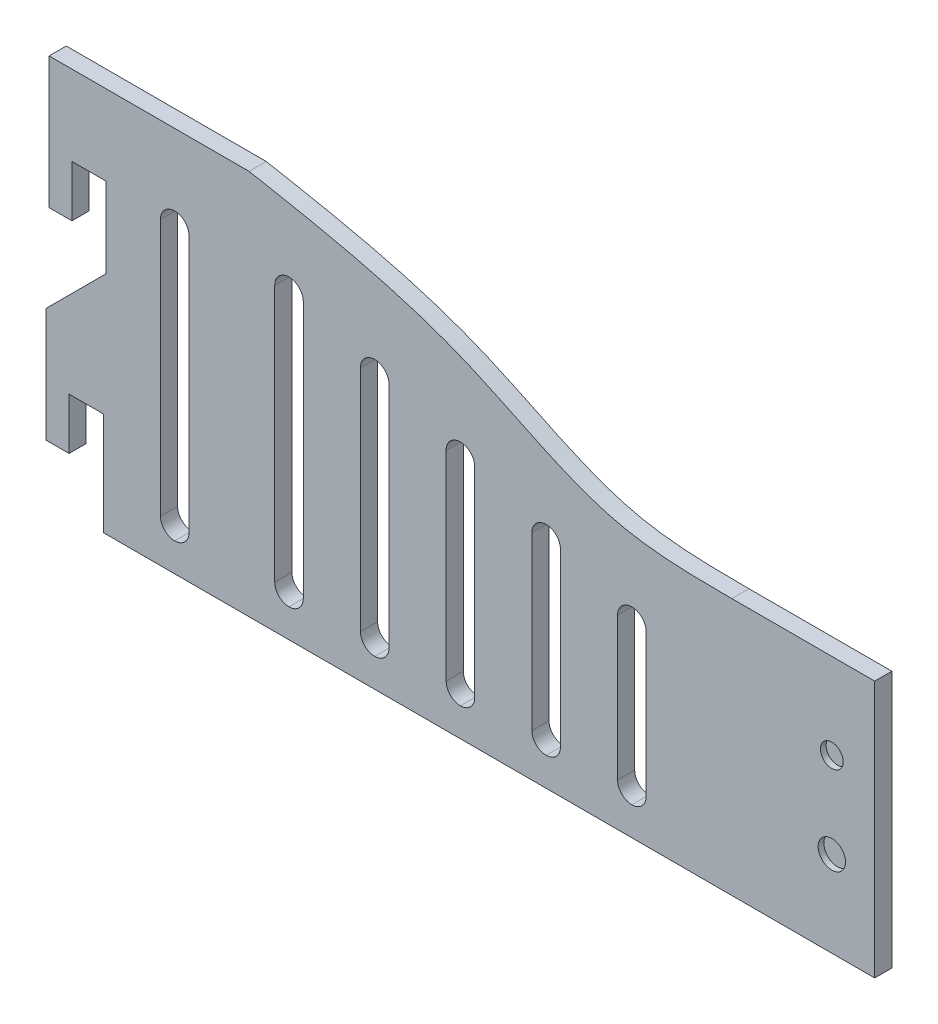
ISO-10303-21;
HEADER;
FILE_DESCRIPTION(('STEP AP214'),'2;1');
FILE_NAME('part.step','',(''),(''),'','','');
FILE_SCHEMA(('AUTOMOTIVE_DESIGN { 1 0 10303 214 1 1 1 1 }'));
ENDSEC;
DATA;
#1=APPLICATION_CONTEXT('core data for automotive mechanical design processes');
#2=APPLICATION_PROTOCOL_DEFINITION('international standard','automotive_design',2000,#1);
#3=PRODUCT_CONTEXT('',#1,'mechanical');
#4=PRODUCT('Part','Part','',(#3));
#5=PRODUCT_RELATED_PRODUCT_CATEGORY('part','',(#4));
#6=PRODUCT_DEFINITION_FORMATION('','',#4);
#7=PRODUCT_DEFINITION_CONTEXT('part definition',#1,'design');
#8=PRODUCT_DEFINITION('design','',#6,#7);
#9=PRODUCT_DEFINITION_SHAPE('','',#8);
#10=(LENGTH_UNIT() NAMED_UNIT(*) SI_UNIT(.MILLI.,.METRE.));
#11=(NAMED_UNIT(*) PLANE_ANGLE_UNIT() SI_UNIT($,.RADIAN.));
#12=(NAMED_UNIT(*) SI_UNIT($,.STERADIAN.) SOLID_ANGLE_UNIT());
#13=UNCERTAINTY_MEASURE_WITH_UNIT(LENGTH_MEASURE(1.E-05),#10,'distance_accuracy_value','');
#14=(GEOMETRIC_REPRESENTATION_CONTEXT(3) GLOBAL_UNCERTAINTY_ASSIGNED_CONTEXT((#13)) GLOBAL_UNIT_ASSIGNED_CONTEXT((#10,
#11,#12)) REPRESENTATION_CONTEXT('',''));
#15=CARTESIAN_POINT('',(0.,0.,0.));
#16=DIRECTION('',(0.,0.,1.));
#17=DIRECTION('',(1.,0.,0.));
#18=AXIS2_PLACEMENT_3D('',#15,#16,#17);
#19=CARTESIAN_POINT('',(67.872608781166,55.6254660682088,3.));
#20=DIRECTION('',(0.,0.,1.));
#21=DIRECTION('',(1.,0.,0.));
#22=AXIS2_PLACEMENT_3D('',#19,#20,#21);
#23=PLANE('',#22);
#24=CARTESIAN_POINT('',(127.5,30.,3.));
#25=DIRECTION('',(0.,0.,1.));
#26=DIRECTION('',(1.,0.,0.));
#27=AXIS2_PLACEMENT_3D('',#24,#25,#26);
#28=CIRCLE('',#27,2.);
#29=CARTESIAN_POINT('',(129.5,30.,3.));
#30=VERTEX_POINT('',#29);
#31=EDGE_CURVE('E1011',#30,#30,#28,.T.);
#32=ORIENTED_EDGE('',*,*,#31,.F.);
#33=EDGE_LOOP('',(#32));
#34=FACE_BOUND('',#33,.T.);
#35=CARTESIAN_POINT('',(127.5,15.,3.));
#36=DIRECTION('',(0.,0.,1.));
#37=DIRECTION('',(1.,0.,0.));
#38=AXIS2_PLACEMENT_3D('',#35,#36,#37);
#39=CIRCLE('',#38,2.4);
#40=CARTESIAN_POINT('',(129.9,15.,3.));
#41=VERTEX_POINT('',#40);
#42=EDGE_CURVE('E1002',#41,#41,#39,.T.);
#43=ORIENTED_EDGE('',*,*,#42,.F.);
#44=EDGE_LOOP('',(#43));
#45=FACE_BOUND('',#44,.T.);
#46=DIRECTION('',(0.,1.,0.));
#47=VECTOR('',#46,1.);
#48=CARTESIAN_POINT('',(80.,40.,3.));
#49=LINE('',#48,#47);
#50=CARTESIAN_POINT('',(80.,7.5,3.));
#51=VERTEX_POINT('',#50);
#52=CARTESIAN_POINT('',(80.,37.5,3.));
#53=VERTEX_POINT('',#52);
#54=EDGE_CURVE('E596',#51,#53,#49,.T.);
#55=ORIENTED_EDGE('',*,*,#54,.F.);
#56=CARTESIAN_POINT('',(77.5,7.5,3.));
#57=DIRECTION('',(0.,0.,1.));
#58=DIRECTION('',(1.,0.,0.));
#59=AXIS2_PLACEMENT_3D('',#56,#57,#58);
#60=CIRCLE('',#59,2.5);
#61=CARTESIAN_POINT('',(77.5,5.,3.));
#62=VERTEX_POINT('',#61);
#63=EDGE_CURVE('E588',#51,#62,#60,.F.);
#64=ORIENTED_EDGE('',*,*,#63,.T.);
#65=CARTESIAN_POINT('',(77.5,7.5,3.));
#66=DIRECTION('',(0.,0.,1.));
#67=DIRECTION('',(1.,0.,0.));
#68=AXIS2_PLACEMENT_3D('',#65,#66,#67);
#69=CIRCLE('',#68,2.5);
#70=CARTESIAN_POINT('',(75.,7.5,3.));
#71=VERTEX_POINT('',#70);
#72=EDGE_CURVE('E537',#62,#71,#69,.F.);
#73=ORIENTED_EDGE('',*,*,#72,.T.);
#74=DIRECTION('',(0.,-1.,0.));
#75=VECTOR('',#74,1.);
#76=CARTESIAN_POINT('',(75.,40.,3.));
#77=LINE('',#76,#75);
#78=CARTESIAN_POINT('',(75.,37.5,3.));
#79=VERTEX_POINT('',#78);
#80=EDGE_CURVE('E614',#79,#71,#77,.T.);
#81=ORIENTED_EDGE('',*,*,#80,.F.);
#82=CARTESIAN_POINT('',(77.5,37.5,3.));
#83=DIRECTION('',(0.,0.,1.));
#84=DIRECTION('',(1.,0.,0.));
#85=AXIS2_PLACEMENT_3D('',#82,#83,#84);
#86=CIRCLE('',#85,2.5);
#87=CARTESIAN_POINT('',(77.5,40.,3.));
#88=VERTEX_POINT('',#87);
#89=EDGE_CURVE('E442',#79,#88,#86,.F.);
#90=ORIENTED_EDGE('',*,*,#89,.T.);
#91=CARTESIAN_POINT('',(77.5,37.5,3.));
#92=DIRECTION('',(0.,0.,1.));
#93=DIRECTION('',(1.,0.,0.));
#94=AXIS2_PLACEMENT_3D('',#91,#92,#93);
#95=CIRCLE('',#94,2.5);
#96=EDGE_CURVE('E475',#88,#53,#95,.F.);
#97=ORIENTED_EDGE('',*,*,#96,.T.);
#98=EDGE_LOOP('',(#55,#64,#73,#81,#90,#97));
#99=FACE_BOUND('',#98,.T.);
#100=DIRECTION('',(0.,1.,0.));
#101=VECTOR('',#100,1.);
#102=CARTESIAN_POINT('',(50.,50.,3.));
#103=LINE('',#102,#101);
#104=CARTESIAN_POINT('',(50.,7.50000000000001,3.));
#105=VERTEX_POINT('',#104);
#106=CARTESIAN_POINT('',(50.,47.5,3.));
#107=VERTEX_POINT('',#106);
#108=EDGE_CURVE('E640',#105,#107,#103,.T.);
#109=ORIENTED_EDGE('',*,*,#108,.F.);
#110=CARTESIAN_POINT('',(47.5,7.5,3.));
#111=DIRECTION('',(0.,0.,1.));
#112=DIRECTION('',(1.,0.,0.));
#113=AXIS2_PLACEMENT_3D('',#110,#111,#112);
#114=CIRCLE('',#113,2.5);
#115=CARTESIAN_POINT('',(47.5,5.,3.));
#116=VERTEX_POINT('',#115);
#117=EDGE_CURVE('E580',#105,#116,#114,.F.);
#118=ORIENTED_EDGE('',*,*,#117,.T.);
#119=CARTESIAN_POINT('',(47.5,7.5,3.));
#120=DIRECTION('',(0.,0.,1.));
#121=DIRECTION('',(1.,0.,0.));
#122=AXIS2_PLACEMENT_3D('',#119,#120,#121);
#123=CIRCLE('',#122,2.5);
#124=CARTESIAN_POINT('',(45.,7.50000000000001,3.));
#125=VERTEX_POINT('',#124);
#126=EDGE_CURVE('E547',#116,#125,#123,.F.);
#127=ORIENTED_EDGE('',*,*,#126,.T.);
#128=DIRECTION('',(0.,-1.,0.));
#129=VECTOR('',#128,1.);
#130=CARTESIAN_POINT('',(45.,50.,3.));
#131=LINE('',#130,#129);
#132=CARTESIAN_POINT('',(45.,47.5,3.));
#133=VERTEX_POINT('',#132);
#134=EDGE_CURVE('E637',#133,#125,#131,.T.);
#135=ORIENTED_EDGE('',*,*,#134,.F.);
#136=CARTESIAN_POINT('',(47.5,47.5,3.));
#137=DIRECTION('',(0.,0.,1.));
#138=DIRECTION('',(1.,0.,0.));
#139=AXIS2_PLACEMENT_3D('',#136,#137,#138);
#140=CIRCLE('',#139,2.5);
#141=CARTESIAN_POINT('',(47.5,50.,3.));
#142=VERTEX_POINT('',#141);
#143=EDGE_CURVE('E424',#133,#142,#140,.F.);
#144=ORIENTED_EDGE('',*,*,#143,.T.);
#145=CARTESIAN_POINT('',(47.5,47.5,3.));
#146=DIRECTION('',(0.,0.,1.));
#147=DIRECTION('',(1.,0.,0.));
#148=AXIS2_PLACEMENT_3D('',#145,#146,#147);
#149=CIRCLE('',#148,2.5);
#150=EDGE_CURVE('E485',#142,#107,#149,.F.);
#151=ORIENTED_EDGE('',*,*,#150,.T.);
#152=EDGE_LOOP('',(#109,#118,#127,#135,#144,#151));
#153=FACE_BOUND('',#152,.T.);
#154=DIRECTION('',(0.,1.,0.));
#155=VECTOR('',#154,1.);
#156=CARTESIAN_POINT('',(15.,55.,3.));
#157=LINE('',#156,#155);
#158=CARTESIAN_POINT('',(15.,7.5,3.));
#159=VERTEX_POINT('',#158);
#160=CARTESIAN_POINT('',(15.,52.5,3.));
#161=VERTEX_POINT('',#160);
#162=EDGE_CURVE('E660',#159,#161,#157,.T.);
#163=ORIENTED_EDGE('',*,*,#162,.F.);
#164=CARTESIAN_POINT('',(12.5,7.5,3.));
#165=DIRECTION('',(0.,0.,1.));
#166=DIRECTION('',(1.,0.,0.));
#167=AXIS2_PLACEMENT_3D('',#164,#165,#166);
#168=CIRCLE('',#167,2.5);
#169=CARTESIAN_POINT('',(12.5,5.,3.));
#170=VERTEX_POINT('',#169);
#171=EDGE_CURVE('E572',#159,#170,#168,.F.);
#172=ORIENTED_EDGE('',*,*,#171,.T.);
#173=CARTESIAN_POINT('',(12.5,7.5,3.));
#174=DIRECTION('',(0.,0.,1.));
#175=DIRECTION('',(1.,0.,0.));
#176=AXIS2_PLACEMENT_3D('',#173,#174,#175);
#177=CIRCLE('',#176,2.5);
#178=CARTESIAN_POINT('',(10.,7.5,3.));
#179=VERTEX_POINT('',#178);
#180=EDGE_CURVE('E557',#170,#179,#177,.F.);
#181=ORIENTED_EDGE('',*,*,#180,.T.);
#182=DIRECTION('',(0.,-1.,0.));
#183=VECTOR('',#182,1.);
#184=CARTESIAN_POINT('',(10.,55.,3.));
#185=LINE('',#184,#183);
#186=CARTESIAN_POINT('',(10.,52.5,3.));
#187=VERTEX_POINT('',#186);
#188=EDGE_CURVE('E657',#187,#179,#185,.T.);
#189=ORIENTED_EDGE('',*,*,#188,.F.);
#190=CARTESIAN_POINT('',(12.5,52.5,3.));
#191=DIRECTION('',(0.,0.,1.));
#192=DIRECTION('',(1.,0.,0.));
#193=AXIS2_PLACEMENT_3D('',#190,#191,#192);
#194=CIRCLE('',#193,2.5);
#195=CARTESIAN_POINT('',(12.5,55.,3.));
#196=VERTEX_POINT('',#195);
#197=EDGE_CURVE('E406',#187,#196,#194,.F.);
#198=ORIENTED_EDGE('',*,*,#197,.T.);
#199=CARTESIAN_POINT('',(12.5,52.5,3.));
#200=DIRECTION('',(0.,0.,1.));
#201=DIRECTION('',(1.,0.,0.));
#202=AXIS2_PLACEMENT_3D('',#199,#200,#201);
#203=CIRCLE('',#202,2.5);
#204=EDGE_CURVE('E399',#196,#161,#203,.F.);
#205=ORIENTED_EDGE('',*,*,#204,.T.);
#206=EDGE_LOOP('',(#163,#172,#181,#189,#198,#205));
#207=FACE_BOUND('',#206,.T.);
#208=DIRECTION('',(0.,-1.,0.));
#209=VECTOR('',#208,1.);
#210=CARTESIAN_POINT('',(0.,0.,3.));
#211=LINE('',#210,#209);
#212=CARTESIAN_POINT('',(0.,18.,3.));
#213=VERTEX_POINT('',#212);
#214=CARTESIAN_POINT('',(0.,0.,3.));
#215=VERTEX_POINT('',#214);
#216=EDGE_CURVE('E371',#213,#215,#211,.T.);
#217=ORIENTED_EDGE('',*,*,#216,.T.);
#218=DIRECTION('',(1.,0.,0.));
#219=VECTOR('',#218,1.);
#220=CARTESIAN_POINT('',(0.,0.,3.));
#221=LINE('',#220,#219);
#222=CARTESIAN_POINT('',(135.,0.,3.));
#223=VERTEX_POINT('',#222);
#224=EDGE_CURVE('E360',#215,#223,#221,.T.);
#225=ORIENTED_EDGE('',*,*,#224,.T.);
#226=DIRECTION('',(0.,1.,0.));
#227=VECTOR('',#226,1.);
#228=CARTESIAN_POINT('',(135.,0.,3.));
#229=LINE('',#228,#227);
#230=CARTESIAN_POINT('',(135.,45.,3.));
#231=VERTEX_POINT('',#230);
#232=EDGE_CURVE('E370',#223,#231,#229,.T.);
#233=ORIENTED_EDGE('',*,*,#232,.T.);
#234=DIRECTION('',(-1.,0.,0.));
#235=VECTOR('',#234,1.);
#236=CARTESIAN_POINT('',(135.,45.,3.));
#237=LINE('',#236,#235);
#238=CARTESIAN_POINT('',(110.,45.,3.));
#239=VERTEX_POINT('',#238);
#240=EDGE_CURVE('E667',#231,#239,#237,.T.);
#241=ORIENTED_EDGE('',*,*,#240,.T.);
#242=CARTESIAN_POINT('',(110.,45.,3.));
#243=CARTESIAN_POINT('',(103.253341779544,45.018959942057,3.));
#244=CARTESIAN_POINT('',(86.7646555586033,45.0652976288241,3.));
#245=CARTESIAN_POINT('',(60.8662208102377,60.8797362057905,3.));
#246=CARTESIAN_POINT('',(38.4520392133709,65.0865338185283,3.));
#247=CARTESIAN_POINT('',(25.514677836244,67.514677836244,3.));
#248=B_SPLINE_CURVE_WITH_KNOTS('',3,(#242,#243,#244,#245,#246,#247),.UNSPECIFIED.,.F.,.F.,(4,1,
1,4),(0.,0.226488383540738,0.553532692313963,1.),.UNSPECIFIED.);
#249=CARTESIAN_POINT('',(25.514677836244,67.514677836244,3.));
#250=VERTEX_POINT('',#249);
#251=EDGE_CURVE('E669',#239,#250,#248,.T.);
#252=ORIENTED_EDGE('',*,*,#251,.T.);
#253=DIRECTION('',(-1.,0.,0.));
#254=VECTOR('',#253,1.);
#255=CARTESIAN_POINT('',(-9.48532216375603,67.514677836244,3.));
#256=LINE('',#255,#254);
#257=CARTESIAN_POINT('',(-9.48532216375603,67.514677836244,3.));
#258=VERTEX_POINT('',#257);
#259=EDGE_CURVE('E674',#250,#258,#256,.T.);
#260=ORIENTED_EDGE('',*,*,#259,.T.);
#261=DIRECTION('',(0.,-1.,0.));
#262=VECTOR('',#261,1.);
#263=CARTESIAN_POINT('',(-9.48532216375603,44.514677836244,3.));
#264=LINE('',#263,#262);
#265=CARTESIAN_POINT('',(-9.48532216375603,44.514677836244,3.));
#266=VERTEX_POINT('',#265);
#267=EDGE_CURVE('E941',#258,#266,#264,.T.);
#268=ORIENTED_EDGE('',*,*,#267,.T.);
#269=DIRECTION('',(1.,0.,0.));
#270=VECTOR('',#269,1.);
#271=CARTESIAN_POINT('',(-5.48532216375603,44.514677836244,3.));
#272=LINE('',#271,#270);
#273=CARTESIAN_POINT('',(-5.48532216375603,44.514677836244,3.));
#274=VERTEX_POINT('',#273);
#275=EDGE_CURVE('E864',#266,#274,#272,.T.);
#276=ORIENTED_EDGE('',*,*,#275,.T.);
#277=DIRECTION('',(0.,1.,0.));
#278=VECTOR('',#277,1.);
#279=CARTESIAN_POINT('',(-5.48532216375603,53.514677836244,3.));
#280=LINE('',#279,#278);
#281=CARTESIAN_POINT('',(-5.48532216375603,53.514677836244,3.));
#282=VERTEX_POINT('',#281);
#283=EDGE_CURVE('E942',#274,#282,#280,.T.);
#284=ORIENTED_EDGE('',*,*,#283,.T.);
#285=DIRECTION('',(1.,0.,0.));
#286=VECTOR('',#285,1.);
#287=CARTESIAN_POINT('',(0.514677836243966,53.514677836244,3.));
#288=LINE('',#287,#286);
#289=CARTESIAN_POINT('',(0.514677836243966,53.514677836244,3.));
#290=VERTEX_POINT('',#289);
#291=EDGE_CURVE('E946',#282,#290,#288,.T.);
#292=ORIENTED_EDGE('',*,*,#291,.T.);
#293=DIRECTION('',(0.,-1.,0.));
#294=VECTOR('',#293,1.);
#295=CARTESIAN_POINT('',(0.514677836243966,39.514677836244,3.));
#296=LINE('',#295,#294);
#297=CARTESIAN_POINT('',(0.514677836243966,39.514677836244,3.));
#298=VERTEX_POINT('',#297);
#299=EDGE_CURVE('E948',#290,#298,#296,.T.);
#300=ORIENTED_EDGE('',*,*,#299,.T.);
#301=DIRECTION('',(-0.707106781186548,-0.707106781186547,0.));
#302=VECTOR('',#301,1.);
#303=CARTESIAN_POINT('',(-10.,29.,3.));
#304=LINE('',#303,#302);
#305=CARTESIAN_POINT('',(-10.,29.,3.));
#306=VERTEX_POINT('',#305);
#307=EDGE_CURVE('E950',#298,#306,#304,.T.);
#308=ORIENTED_EDGE('',*,*,#307,.T.);
#309=DIRECTION('',(0.,-1.,0.));
#310=VECTOR('',#309,1.);
#311=CARTESIAN_POINT('',(-10.,9.,3.));
#312=LINE('',#311,#310);
#313=CARTESIAN_POINT('',(-10.,9.,3.));
#314=VERTEX_POINT('',#313);
#315=EDGE_CURVE('E952',#306,#314,#312,.T.);
#316=ORIENTED_EDGE('',*,*,#315,.T.);
#317=DIRECTION('',(1.,0.,0.));
#318=VECTOR('',#317,1.);
#319=CARTESIAN_POINT('',(-6.,9.,3.));
#320=LINE('',#319,#318);
#321=CARTESIAN_POINT('',(-6.,9.,3.));
#322=VERTEX_POINT('',#321);
#323=EDGE_CURVE('E954',#314,#322,#320,.T.);
#324=ORIENTED_EDGE('',*,*,#323,.T.);
#325=DIRECTION('',(0.,1.,0.));
#326=VECTOR('',#325,1.);
#327=CARTESIAN_POINT('',(-6.,18.,3.));
#328=LINE('',#327,#326);
#329=CARTESIAN_POINT('',(-6.,18.,3.));
#330=VERTEX_POINT('',#329);
#331=EDGE_CURVE('E956',#322,#330,#328,.T.);
#332=ORIENTED_EDGE('',*,*,#331,.T.);
#333=DIRECTION('',(1.,0.,0.));
#334=VECTOR('',#333,1.);
#335=CARTESIAN_POINT('',(0.,18.,3.));
#336=LINE('',#335,#334);
#337=EDGE_CURVE('E376',#330,#213,#336,.T.);
#338=ORIENTED_EDGE('',*,*,#337,.T.);
#339=EDGE_LOOP('',(#217,#225,#233,#241,#252,#260,#268,#276,#284,#292,#300,#308,#316,#324,#332,#338));
#340=FACE_BOUND('',#339,.T.);
#341=DIRECTION('',(0.,1.,0.));
#342=VECTOR('',#341,1.);
#343=CARTESIAN_POINT('',(35.,55.,3.));
#344=LINE('',#343,#342);
#345=CARTESIAN_POINT('',(35.,7.5,3.));
#346=VERTEX_POINT('',#345);
#347=CARTESIAN_POINT('',(35.,52.5,3.));
#348=VERTEX_POINT('',#347);
#349=EDGE_CURVE('E650',#346,#348,#344,.T.);
#350=ORIENTED_EDGE('',*,*,#349,.F.);
#351=CARTESIAN_POINT('',(32.5,7.5,3.));
#352=DIRECTION('',(0.,0.,1.));
#353=DIRECTION('',(1.,0.,0.));
#354=AXIS2_PLACEMENT_3D('',#351,#352,#353);
#355=CIRCLE('',#354,2.5);
#356=CARTESIAN_POINT('',(32.5,5.,3.));
#357=VERTEX_POINT('',#356);
#358=EDGE_CURVE('E576',#346,#357,#355,.F.);
#359=ORIENTED_EDGE('',*,*,#358,.T.);
#360=CARTESIAN_POINT('',(32.5,7.5,3.));
#361=DIRECTION('',(0.,0.,1.));
#362=DIRECTION('',(1.,0.,0.));
#363=AXIS2_PLACEMENT_3D('',#360,#361,#362);
#364=CIRCLE('',#363,2.5);
#365=CARTESIAN_POINT('',(30.,7.5,3.));
#366=VERTEX_POINT('',#365);
#367=EDGE_CURVE('E552',#357,#366,#364,.F.);
#368=ORIENTED_EDGE('',*,*,#367,.T.);
#369=DIRECTION('',(0.,-1.,0.));
#370=VECTOR('',#369,1.);
#371=CARTESIAN_POINT('',(30.,55.,3.));
#372=LINE('',#371,#370);
#373=CARTESIAN_POINT('',(30.,52.5,3.));
#374=VERTEX_POINT('',#373);
#375=EDGE_CURVE('E647',#374,#366,#372,.T.);
#376=ORIENTED_EDGE('',*,*,#375,.F.);
#377=CARTESIAN_POINT('',(32.5,52.5,3.));
#378=DIRECTION('',(0.,0.,1.));
#379=DIRECTION('',(1.,0.,0.));
#380=AXIS2_PLACEMENT_3D('',#377,#378,#379);
#381=CIRCLE('',#380,2.5);
#382=CARTESIAN_POINT('',(32.5,55.,3.));
#383=VERTEX_POINT('',#382);
#384=EDGE_CURVE('E415',#374,#383,#381,.F.);
#385=ORIENTED_EDGE('',*,*,#384,.T.);
#386=CARTESIAN_POINT('',(32.5,52.5,3.));
#387=DIRECTION('',(0.,0.,1.));
#388=DIRECTION('',(1.,0.,0.));
#389=AXIS2_PLACEMENT_3D('',#386,#387,#388);
#390=CIRCLE('',#389,2.5);
#391=EDGE_CURVE('E449',#383,#348,#390,.F.);
#392=ORIENTED_EDGE('',*,*,#391,.T.);
#393=EDGE_LOOP('',(#350,#359,#368,#376,#385,#392));
#394=FACE_BOUND('',#393,.T.);
#395=DIRECTION('',(0.,1.,0.));
#396=VECTOR('',#395,1.);
#397=CARTESIAN_POINT('',(65.,45.,3.));
#398=LINE('',#397,#396);
#399=CARTESIAN_POINT('',(65.,7.5,3.));
#400=VERTEX_POINT('',#399);
#401=CARTESIAN_POINT('',(65.,42.5,3.));
#402=VERTEX_POINT('',#401);
#403=EDGE_CURVE('E630',#400,#402,#398,.T.);
#404=ORIENTED_EDGE('',*,*,#403,.F.);
#405=CARTESIAN_POINT('',(62.5,7.5,3.));
#406=DIRECTION('',(0.,0.,1.));
#407=DIRECTION('',(1.,0.,0.));
#408=AXIS2_PLACEMENT_3D('',#405,#406,#407);
#409=CIRCLE('',#408,2.5);
#410=CARTESIAN_POINT('',(62.5,5.,3.));
#411=VERTEX_POINT('',#410);
#412=EDGE_CURVE('E584',#400,#411,#409,.F.);
#413=ORIENTED_EDGE('',*,*,#412,.T.);
#414=CARTESIAN_POINT('',(62.5,7.5,3.));
#415=DIRECTION('',(0.,0.,1.));
#416=DIRECTION('',(1.,0.,0.));
#417=AXIS2_PLACEMENT_3D('',#414,#415,#416);
#418=CIRCLE('',#417,2.5);
#419=CARTESIAN_POINT('',(60.,7.5,3.));
#420=VERTEX_POINT('',#419);
#421=EDGE_CURVE('E542',#411,#420,#418,.F.);
#422=ORIENTED_EDGE('',*,*,#421,.T.);
#423=DIRECTION('',(0.,-1.,0.));
#424=VECTOR('',#423,1.);
#425=CARTESIAN_POINT('',(60.,45.,3.));
#426=LINE('',#425,#424);
#427=CARTESIAN_POINT('',(60.,42.5,3.));
#428=VERTEX_POINT('',#427);
#429=EDGE_CURVE('E627',#428,#420,#426,.T.);
#430=ORIENTED_EDGE('',*,*,#429,.F.);
#431=CARTESIAN_POINT('',(62.5,42.5,3.));
#432=DIRECTION('',(0.,0.,1.));
#433=DIRECTION('',(1.,0.,0.));
#434=AXIS2_PLACEMENT_3D('',#431,#432,#433);
#435=CIRCLE('',#434,2.5);
#436=CARTESIAN_POINT('',(62.5,45.,3.));
#437=VERTEX_POINT('',#436);
#438=EDGE_CURVE('E433',#428,#437,#435,.F.);
#439=ORIENTED_EDGE('',*,*,#438,.T.);
#440=CARTESIAN_POINT('',(62.5,42.5,3.));
#441=DIRECTION('',(0.,0.,1.));
#442=DIRECTION('',(1.,0.,0.));
#443=AXIS2_PLACEMENT_3D('',#440,#441,#442);
#444=CIRCLE('',#443,2.5);
#445=EDGE_CURVE('E480',#437,#402,#444,.F.);
#446=ORIENTED_EDGE('',*,*,#445,.T.);
#447=EDGE_LOOP('',(#404,#413,#422,#430,#439,#446));
#448=FACE_BOUND('',#447,.T.);
#449=DIRECTION('',(0.,1.,0.));
#450=VECTOR('',#449,1.);
#451=CARTESIAN_POINT('',(95.,35.,3.));
#452=LINE('',#451,#450);
#453=CARTESIAN_POINT('',(95.,7.50000000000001,3.));
#454=VERTEX_POINT('',#453);
#455=CARTESIAN_POINT('',(95.,32.5,3.));
#456=VERTEX_POINT('',#455);
#457=EDGE_CURVE('E625',#454,#456,#452,.T.);
#458=ORIENTED_EDGE('',*,*,#457,.F.);
#459=CARTESIAN_POINT('',(92.5,7.5,3.));
#460=DIRECTION('',(0.,0.,1.));
#461=DIRECTION('',(1.,0.,0.));
#462=AXIS2_PLACEMENT_3D('',#459,#460,#461);
#463=CIRCLE('',#462,2.5);
#464=CARTESIAN_POINT('',(92.5,5.,3.));
#465=VERTEX_POINT('',#464);
#466=EDGE_CURVE('E11',#454,#465,#463,.F.);
#467=ORIENTED_EDGE('',*,*,#466,.T.);
#468=CARTESIAN_POINT('',(92.5,7.5,3.));
#469=DIRECTION('',(0.,0.,1.));
#470=DIRECTION('',(1.,0.,0.));
#471=AXIS2_PLACEMENT_3D('',#468,#469,#470);
#472=CIRCLE('',#471,2.5);
#473=CARTESIAN_POINT('',(90.,7.50000000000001,3.));
#474=VERTEX_POINT('',#473);
#475=EDGE_CURVE('E532',#465,#474,#472,.F.);
#476=ORIENTED_EDGE('',*,*,#475,.T.);
#477=DIRECTION('',(0.,-1.,0.));
#478=VECTOR('',#477,1.);
#479=CARTESIAN_POINT('',(90.,35.,3.));
#480=LINE('',#479,#478);
#481=CARTESIAN_POINT('',(90.,32.5,3.));
#482=VERTEX_POINT('',#481);
#483=EDGE_CURVE('E994',#482,#474,#480,.T.);
#484=ORIENTED_EDGE('',*,*,#483,.F.);
#485=CARTESIAN_POINT('',(92.5,32.5,3.));
#486=DIRECTION('',(0.,0.,1.));
#487=DIRECTION('',(1.,0.,0.));
#488=AXIS2_PLACEMENT_3D('',#485,#486,#487);
#489=CIRCLE('',#488,2.5);
#490=CARTESIAN_POINT('',(92.5,35.,3.));
#491=VERTEX_POINT('',#490);
#492=EDGE_CURVE('E492',#482,#491,#489,.F.);
#493=ORIENTED_EDGE('',*,*,#492,.T.);
#494=CARTESIAN_POINT('',(92.5,32.5,3.));
#495=DIRECTION('',(0.,0.,1.));
#496=DIRECTION('',(1.,0.,0.));
#497=AXIS2_PLACEMENT_3D('',#494,#495,#496);
#498=CIRCLE('',#497,2.5);
#499=EDGE_CURVE('E470',#491,#456,#498,.F.);
#500=ORIENTED_EDGE('',*,*,#499,.T.);
#501=EDGE_LOOP('',(#458,#467,#476,#484,#493,#500));
#502=FACE_BOUND('',#501,.T.);
#503=ADVANCED_FACE('F33',(#34,#45,#99,#153,#207,#340,#394,#448,#502),#23,.T.);
#504=CARTESIAN_POINT('',(67.872608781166,55.6254660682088,0.));
#505=DIRECTION('',(0.,0.,1.));
#506=DIRECTION('',(1.,0.,0.));
#507=AXIS2_PLACEMENT_3D('',#504,#505,#506);
#508=PLANE('',#507);
#509=CARTESIAN_POINT('',(77.5,7.5,0.));
#510=DIRECTION('',(0.,0.,1.));
#511=DIRECTION('',(1.,0.,0.));
#512=AXIS2_PLACEMENT_3D('',#509,#510,#511);
#513=CIRCLE('',#512,2.5);
#514=CARTESIAN_POINT('',(75.,7.5,0.));
#515=VERTEX_POINT('',#514);
#516=CARTESIAN_POINT('',(77.5,5.,0.));
#517=VERTEX_POINT('',#516);
#518=EDGE_CURVE('E534',#515,#517,#513,.T.);
#519=ORIENTED_EDGE('',*,*,#518,.T.);
#520=CARTESIAN_POINT('',(77.5,7.5,0.));
#521=DIRECTION('',(0.,0.,1.));
#522=DIRECTION('',(1.,0.,0.));
#523=AXIS2_PLACEMENT_3D('',#520,#521,#522);
#524=CIRCLE('',#523,2.5);
#525=CARTESIAN_POINT('',(80.,7.5,0.));
#526=VERTEX_POINT('',#525);
#527=EDGE_CURVE('E586',#517,#526,#524,.T.);
#528=ORIENTED_EDGE('',*,*,#527,.T.);
#529=DIRECTION('',(0.,1.,0.));
#530=VECTOR('',#529,1.);
#531=CARTESIAN_POINT('',(80.,40.,0.));
#532=LINE('',#531,#530);
#533=CARTESIAN_POINT('',(80.,37.5,0.));
#534=VERTEX_POINT('',#533);
#535=EDGE_CURVE('E616',#526,#534,#532,.T.);
#536=ORIENTED_EDGE('',*,*,#535,.T.);
#537=CARTESIAN_POINT('',(77.5,37.5,0.));
#538=DIRECTION('',(0.,0.,1.));
#539=DIRECTION('',(1.,0.,0.));
#540=AXIS2_PLACEMENT_3D('',#537,#538,#539);
#541=CIRCLE('',#540,2.5);
#542=CARTESIAN_POINT('',(77.5,40.,0.));
#543=VERTEX_POINT('',#542);
#544=EDGE_CURVE('E473',#534,#543,#541,.T.);
#545=ORIENTED_EDGE('',*,*,#544,.T.);
#546=CARTESIAN_POINT('',(77.5,37.5,0.));
#547=DIRECTION('',(0.,0.,1.));
#548=DIRECTION('',(1.,0.,0.));
#549=AXIS2_PLACEMENT_3D('',#546,#547,#548);
#550=CIRCLE('',#549,2.5);
#551=CARTESIAN_POINT('',(75.,37.5,0.));
#552=VERTEX_POINT('',#551);
#553=EDGE_CURVE('E440',#543,#552,#550,.T.);
#554=ORIENTED_EDGE('',*,*,#553,.T.);
#555=DIRECTION('',(0.,-1.,0.));
#556=VECTOR('',#555,1.);
#557=CARTESIAN_POINT('',(75.,40.,0.));
#558=LINE('',#557,#556);
#559=EDGE_CURVE('E610',#552,#515,#558,.T.);
#560=ORIENTED_EDGE('',*,*,#559,.T.);
#561=EDGE_LOOP('',(#519,#528,#536,#545,#554,#560));
#562=FACE_BOUND('',#561,.T.);
#563=CARTESIAN_POINT('',(47.5,7.5,0.));
#564=DIRECTION('',(0.,0.,1.));
#565=DIRECTION('',(1.,0.,0.));
#566=AXIS2_PLACEMENT_3D('',#563,#564,#565);
#567=CIRCLE('',#566,2.5);
#568=CARTESIAN_POINT('',(45.,7.50000000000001,0.));
#569=VERTEX_POINT('',#568);
#570=CARTESIAN_POINT('',(47.5,5.,0.));
#571=VERTEX_POINT('',#570);
#572=EDGE_CURVE('E544',#569,#571,#567,.T.);
#573=ORIENTED_EDGE('',*,*,#572,.T.);
#574=CARTESIAN_POINT('',(47.5,7.5,0.));
#575=DIRECTION('',(0.,0.,1.));
#576=DIRECTION('',(1.,0.,0.));
#577=AXIS2_PLACEMENT_3D('',#574,#575,#576);
#578=CIRCLE('',#577,2.5);
#579=CARTESIAN_POINT('',(50.,7.50000000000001,0.));
#580=VERTEX_POINT('',#579);
#581=EDGE_CURVE('E578',#571,#580,#578,.T.);
#582=ORIENTED_EDGE('',*,*,#581,.T.);
#583=DIRECTION('',(0.,1.,0.));
#584=VECTOR('',#583,1.);
#585=CARTESIAN_POINT('',(50.,50.,0.));
#586=LINE('',#585,#584);
#587=CARTESIAN_POINT('',(50.,47.5,0.));
#588=VERTEX_POINT('',#587);
#589=EDGE_CURVE('E641',#580,#588,#586,.T.);
#590=ORIENTED_EDGE('',*,*,#589,.T.);
#591=CARTESIAN_POINT('',(47.5,47.5,0.));
#592=DIRECTION('',(0.,0.,1.));
#593=DIRECTION('',(1.,0.,0.));
#594=AXIS2_PLACEMENT_3D('',#591,#592,#593);
#595=CIRCLE('',#594,2.5);
#596=CARTESIAN_POINT('',(47.5,50.,0.));
#597=VERTEX_POINT('',#596);
#598=EDGE_CURVE('E483',#588,#597,#595,.T.);
#599=ORIENTED_EDGE('',*,*,#598,.T.);
#600=CARTESIAN_POINT('',(47.5,47.5,0.));
#601=DIRECTION('',(0.,0.,1.));
#602=DIRECTION('',(1.,0.,0.));
#603=AXIS2_PLACEMENT_3D('',#600,#601,#602);
#604=CIRCLE('',#603,2.5);
#605=CARTESIAN_POINT('',(45.,47.5,0.));
#606=VERTEX_POINT('',#605);
#607=EDGE_CURVE('E422',#597,#606,#604,.T.);
#608=ORIENTED_EDGE('',*,*,#607,.T.);
#609=DIRECTION('',(0.,-1.,0.));
#610=VECTOR('',#609,1.);
#611=CARTESIAN_POINT('',(45.,50.,0.));
#612=LINE('',#611,#610);
#613=EDGE_CURVE('E633',#606,#569,#612,.T.);
#614=ORIENTED_EDGE('',*,*,#613,.T.);
#615=EDGE_LOOP('',(#573,#582,#590,#599,#608,#614));
#616=FACE_BOUND('',#615,.T.);
#617=CARTESIAN_POINT('',(12.5,52.5,0.));
#618=DIRECTION('',(0.,0.,1.));
#619=DIRECTION('',(1.,0.,0.));
#620=AXIS2_PLACEMENT_3D('',#617,#618,#619);
#621=CIRCLE('',#620,2.5);
#622=CARTESIAN_POINT('',(15.,52.5,0.));
#623=VERTEX_POINT('',#622);
#624=CARTESIAN_POINT('',(12.5,55.,0.));
#625=VERTEX_POINT('',#624);
#626=EDGE_CURVE('E396',#623,#625,#621,.T.);
#627=ORIENTED_EDGE('',*,*,#626,.T.);
#628=CARTESIAN_POINT('',(12.5,52.5,0.));
#629=DIRECTION('',(0.,0.,1.));
#630=DIRECTION('',(1.,0.,0.));
#631=AXIS2_PLACEMENT_3D('',#628,#629,#630);
#632=CIRCLE('',#631,2.5);
#633=CARTESIAN_POINT('',(10.,52.5,0.));
#634=VERTEX_POINT('',#633);
#635=EDGE_CURVE('E404',#625,#634,#632,.T.);
#636=ORIENTED_EDGE('',*,*,#635,.T.);
#637=DIRECTION('',(0.,-1.,0.));
#638=VECTOR('',#637,1.);
#639=CARTESIAN_POINT('',(10.,55.,0.));
#640=LINE('',#639,#638);
#641=CARTESIAN_POINT('',(10.,7.5,0.));
#642=VERTEX_POINT('',#641);
#643=EDGE_CURVE('E653',#634,#642,#640,.T.);
#644=ORIENTED_EDGE('',*,*,#643,.T.);
#645=CARTESIAN_POINT('',(12.5,7.5,0.));
#646=DIRECTION('',(0.,0.,1.));
#647=DIRECTION('',(1.,0.,0.));
#648=AXIS2_PLACEMENT_3D('',#645,#646,#647);
#649=CIRCLE('',#648,2.5);
#650=CARTESIAN_POINT('',(12.5,5.,0.));
#651=VERTEX_POINT('',#650);
#652=EDGE_CURVE('E554',#642,#651,#649,.T.);
#653=ORIENTED_EDGE('',*,*,#652,.T.);
#654=CARTESIAN_POINT('',(12.5,7.5,0.));
#655=DIRECTION('',(0.,0.,1.));
#656=DIRECTION('',(1.,0.,0.));
#657=AXIS2_PLACEMENT_3D('',#654,#655,#656);
#658=CIRCLE('',#657,2.5);
#659=CARTESIAN_POINT('',(15.,7.5,0.));
#660=VERTEX_POINT('',#659);
#661=EDGE_CURVE('E570',#651,#660,#658,.T.);
#662=ORIENTED_EDGE('',*,*,#661,.T.);
#663=DIRECTION('',(0.,1.,0.));
#664=VECTOR('',#663,1.);
#665=CARTESIAN_POINT('',(15.,55.,0.));
#666=LINE('',#665,#664);
#667=EDGE_CURVE('E661',#660,#623,#666,.T.);
#668=ORIENTED_EDGE('',*,*,#667,.T.);
#669=EDGE_LOOP('',(#627,#636,#644,#653,#662,#668));
#670=FACE_BOUND('',#669,.T.);
#671=DIRECTION('',(0.,-1.,0.));
#672=VECTOR('',#671,1.);
#673=CARTESIAN_POINT('',(0.,0.,0.));
#674=LINE('',#673,#672);
#675=CARTESIAN_POINT('',(0.,18.,0.));
#676=VERTEX_POINT('',#675);
#677=CARTESIAN_POINT('',(0.,0.,0.));
#678=VERTEX_POINT('',#677);
#679=EDGE_CURVE('E384',#676,#678,#674,.T.);
#680=ORIENTED_EDGE('',*,*,#679,.F.);
#681=DIRECTION('',(1.,0.,0.));
#682=VECTOR('',#681,1.);
#683=CARTESIAN_POINT('',(0.,18.,0.));
#684=LINE('',#683,#682);
#685=CARTESIAN_POINT('',(-6.,18.,0.));
#686=VERTEX_POINT('',#685);
#687=EDGE_CURVE('E380',#686,#676,#684,.T.);
#688=ORIENTED_EDGE('',*,*,#687,.F.);
#689=DIRECTION('',(0.,1.,0.));
#690=VECTOR('',#689,1.);
#691=CARTESIAN_POINT('',(-6.,18.,0.));
#692=LINE('',#691,#690);
#693=CARTESIAN_POINT('',(-6.,9.,0.));
#694=VERTEX_POINT('',#693);
#695=EDGE_CURVE('E885',#694,#686,#692,.T.);
#696=ORIENTED_EDGE('',*,*,#695,.F.);
#697=DIRECTION('',(1.,0.,0.));
#698=VECTOR('',#697,1.);
#699=CARTESIAN_POINT('',(-6.,9.,0.));
#700=LINE('',#699,#698);
#701=CARTESIAN_POINT('',(-10.,9.,0.));
#702=VERTEX_POINT('',#701);
#703=EDGE_CURVE('E883',#702,#694,#700,.T.);
#704=ORIENTED_EDGE('',*,*,#703,.F.);
#705=DIRECTION('',(0.,-1.,0.));
#706=VECTOR('',#705,1.);
#707=CARTESIAN_POINT('',(-10.,9.,0.));
#708=LINE('',#707,#706);
#709=CARTESIAN_POINT('',(-10.,29.,0.));
#710=VERTEX_POINT('',#709);
#711=EDGE_CURVE('E881',#710,#702,#708,.T.);
#712=ORIENTED_EDGE('',*,*,#711,.F.);
#713=DIRECTION('',(-0.707106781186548,-0.707106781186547,0.));
#714=VECTOR('',#713,1.);
#715=CARTESIAN_POINT('',(-10.,29.,0.));
#716=LINE('',#715,#714);
#717=CARTESIAN_POINT('',(0.514677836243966,39.514677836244,0.));
#718=VERTEX_POINT('',#717);
#719=EDGE_CURVE('E879',#718,#710,#716,.T.);
#720=ORIENTED_EDGE('',*,*,#719,.F.);
#721=DIRECTION('',(0.,-1.,0.));
#722=VECTOR('',#721,1.);
#723=CARTESIAN_POINT('',(0.514677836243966,39.514677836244,0.));
#724=LINE('',#723,#722);
#725=CARTESIAN_POINT('',(0.514677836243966,53.514677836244,0.));
#726=VERTEX_POINT('',#725);
#727=EDGE_CURVE('E877',#726,#718,#724,.T.);
#728=ORIENTED_EDGE('',*,*,#727,.F.);
#729=DIRECTION('',(1.,0.,0.));
#730=VECTOR('',#729,1.);
#731=CARTESIAN_POINT('',(0.514677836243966,53.514677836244,0.));
#732=LINE('',#731,#730);
#733=CARTESIAN_POINT('',(-5.48532216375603,53.514677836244,0.));
#734=VERTEX_POINT('',#733);
#735=EDGE_CURVE('E872',#734,#726,#732,.T.);
#736=ORIENTED_EDGE('',*,*,#735,.F.);
#737=DIRECTION('',(0.,1.,0.));
#738=VECTOR('',#737,1.);
#739=CARTESIAN_POINT('',(-5.48532216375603,53.514677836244,0.));
#740=LINE('',#739,#738);
#741=CARTESIAN_POINT('',(-5.48532216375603,44.514677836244,0.));
#742=VERTEX_POINT('',#741);
#743=EDGE_CURVE('E870',#742,#734,#740,.T.);
#744=ORIENTED_EDGE('',*,*,#743,.F.);
#745=DIRECTION('',(1.,0.,0.));
#746=VECTOR('',#745,1.);
#747=CARTESIAN_POINT('',(-5.48532216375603,44.514677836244,0.));
#748=LINE('',#747,#746);
#749=CARTESIAN_POINT('',(-9.48532216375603,44.514677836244,0.));
#750=VERTEX_POINT('',#749);
#751=EDGE_CURVE('E859',#750,#742,#748,.T.);
#752=ORIENTED_EDGE('',*,*,#751,.F.);
#753=DIRECTION('',(0.,-1.,0.));
#754=VECTOR('',#753,1.);
#755=CARTESIAN_POINT('',(-9.48532216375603,44.514677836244,0.));
#756=LINE('',#755,#754);
#757=CARTESIAN_POINT('',(-9.48532216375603,67.514677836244,0.));
#758=VERTEX_POINT('',#757);
#759=EDGE_CURVE('E849',#758,#750,#756,.T.);
#760=ORIENTED_EDGE('',*,*,#759,.F.);
#761=DIRECTION('',(-1.,0.,0.));
#762=VECTOR('',#761,1.);
#763=CARTESIAN_POINT('',(-9.48532216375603,67.514677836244,0.));
#764=LINE('',#763,#762);
#765=CARTESIAN_POINT('',(25.514677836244,67.514677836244,0.));
#766=VERTEX_POINT('',#765);
#767=EDGE_CURVE('E860',#766,#758,#764,.T.);
#768=ORIENTED_EDGE('',*,*,#767,.F.);
#769=CARTESIAN_POINT('',(110.,45.,0.));
#770=CARTESIAN_POINT('',(103.253341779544,45.018959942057,0.));
#771=CARTESIAN_POINT('',(86.7646555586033,45.0652976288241,0.));
#772=CARTESIAN_POINT('',(60.8662208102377,60.8797362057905,0.));
#773=CARTESIAN_POINT('',(38.4520392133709,65.0865338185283,0.));
#774=CARTESIAN_POINT('',(25.514677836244,67.514677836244,0.));
#775=B_SPLINE_CURVE_WITH_KNOTS('',3,(#769,#770,#771,#772,#773,#774),.UNSPECIFIED.,.F.,.F.,(4,1,
1,4),(0.,0.226488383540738,0.553532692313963,1.),.UNSPECIFIED.);
#776=CARTESIAN_POINT('',(110.,45.,0.));
#777=VERTEX_POINT('',#776);
#778=EDGE_CURVE('E927',#777,#766,#775,.T.);
#779=ORIENTED_EDGE('',*,*,#778,.F.);
#780=DIRECTION('',(-1.,0.,0.));
#781=VECTOR('',#780,1.);
#782=CARTESIAN_POINT('',(135.,45.,0.));
#783=LINE('',#782,#781);
#784=CARTESIAN_POINT('',(135.,45.,0.));
#785=VERTEX_POINT('',#784);
#786=EDGE_CURVE('E923',#785,#777,#783,.T.);
#787=ORIENTED_EDGE('',*,*,#786,.F.);
#788=DIRECTION('',(0.,1.,0.));
#789=VECTOR('',#788,1.);
#790=CARTESIAN_POINT('',(135.,0.,0.));
#791=LINE('',#790,#789);
#792=CARTESIAN_POINT('',(135.,0.,0.));
#793=VERTEX_POINT('',#792);
#794=EDGE_CURVE('E926',#793,#785,#791,.T.);
#795=ORIENTED_EDGE('',*,*,#794,.F.);
#796=DIRECTION('',(1.,0.,0.));
#797=VECTOR('',#796,1.);
#798=CARTESIAN_POINT('',(0.,0.,0.));
#799=LINE('',#798,#797);
#800=EDGE_CURVE('E930',#678,#793,#799,.T.);
#801=ORIENTED_EDGE('',*,*,#800,.F.);
#802=EDGE_LOOP('',(#680,#688,#696,#704,#712,#720,#728,#736,#744,#752,#760,#768,#779,#787,#795,#801));
#803=FACE_BOUND('',#802,.T.);
#804=CARTESIAN_POINT('',(32.5,7.5,0.));
#805=DIRECTION('',(0.,0.,1.));
#806=DIRECTION('',(1.,0.,0.));
#807=AXIS2_PLACEMENT_3D('',#804,#805,#806);
#808=CIRCLE('',#807,2.5);
#809=CARTESIAN_POINT('',(30.,7.5,0.));
#810=VERTEX_POINT('',#809);
#811=CARTESIAN_POINT('',(32.5,5.,0.));
#812=VERTEX_POINT('',#811);
#813=EDGE_CURVE('E549',#810,#812,#808,.T.);
#814=ORIENTED_EDGE('',*,*,#813,.T.);
#815=CARTESIAN_POINT('',(32.5,7.5,0.));
#816=DIRECTION('',(0.,0.,1.));
#817=DIRECTION('',(1.,0.,0.));
#818=AXIS2_PLACEMENT_3D('',#815,#816,#817);
#819=CIRCLE('',#818,2.5);
#820=CARTESIAN_POINT('',(35.,7.5,0.));
#821=VERTEX_POINT('',#820);
#822=EDGE_CURVE('E574',#812,#821,#819,.T.);
#823=ORIENTED_EDGE('',*,*,#822,.T.);
#824=DIRECTION('',(0.,1.,0.));
#825=VECTOR('',#824,1.);
#826=CARTESIAN_POINT('',(35.,55.,0.));
#827=LINE('',#826,#825);
#828=CARTESIAN_POINT('',(35.,52.5,0.));
#829=VERTEX_POINT('',#828);
#830=EDGE_CURVE('E651',#821,#829,#827,.T.);
#831=ORIENTED_EDGE('',*,*,#830,.T.);
#832=CARTESIAN_POINT('',(32.5,52.5,0.));
#833=DIRECTION('',(0.,0.,1.));
#834=DIRECTION('',(1.,0.,0.));
#835=AXIS2_PLACEMENT_3D('',#832,#833,#834);
#836=CIRCLE('',#835,2.5);
#837=CARTESIAN_POINT('',(32.5,55.,0.));
#838=VERTEX_POINT('',#837);
#839=EDGE_CURVE('E447',#829,#838,#836,.T.);
#840=ORIENTED_EDGE('',*,*,#839,.T.);
#841=CARTESIAN_POINT('',(32.5,52.5,0.));
#842=DIRECTION('',(0.,0.,1.));
#843=DIRECTION('',(1.,0.,0.));
#844=AXIS2_PLACEMENT_3D('',#841,#842,#843);
#845=CIRCLE('',#844,2.5);
#846=CARTESIAN_POINT('',(30.,52.5,0.));
#847=VERTEX_POINT('',#846);
#848=EDGE_CURVE('E413',#838,#847,#845,.T.);
#849=ORIENTED_EDGE('',*,*,#848,.T.);
#850=DIRECTION('',(0.,-1.,0.));
#851=VECTOR('',#850,1.);
#852=CARTESIAN_POINT('',(30.,55.,0.));
#853=LINE('',#852,#851);
#854=EDGE_CURVE('E643',#847,#810,#853,.T.);
#855=ORIENTED_EDGE('',*,*,#854,.T.);
#856=EDGE_LOOP('',(#814,#823,#831,#840,#849,#855));
#857=FACE_BOUND('',#856,.T.);
#858=CARTESIAN_POINT('',(62.5,7.5,0.));
#859=DIRECTION('',(0.,0.,1.));
#860=DIRECTION('',(1.,0.,0.));
#861=AXIS2_PLACEMENT_3D('',#858,#859,#860);
#862=CIRCLE('',#861,2.5);
#863=CARTESIAN_POINT('',(60.,7.5,0.));
#864=VERTEX_POINT('',#863);
#865=CARTESIAN_POINT('',(62.5,5.,0.));
#866=VERTEX_POINT('',#865);
#867=EDGE_CURVE('E539',#864,#866,#862,.T.);
#868=ORIENTED_EDGE('',*,*,#867,.T.);
#869=CARTESIAN_POINT('',(62.5,7.5,0.));
#870=DIRECTION('',(0.,0.,1.));
#871=DIRECTION('',(1.,0.,0.));
#872=AXIS2_PLACEMENT_3D('',#869,#870,#871);
#873=CIRCLE('',#872,2.5);
#874=CARTESIAN_POINT('',(65.,7.5,0.));
#875=VERTEX_POINT('',#874);
#876=EDGE_CURVE('E582',#866,#875,#873,.T.);
#877=ORIENTED_EDGE('',*,*,#876,.T.);
#878=DIRECTION('',(0.,1.,0.));
#879=VECTOR('',#878,1.);
#880=CARTESIAN_POINT('',(65.,45.,0.));
#881=LINE('',#880,#879);
#882=CARTESIAN_POINT('',(65.,42.5,0.));
#883=VERTEX_POINT('',#882);
#884=EDGE_CURVE('E631',#875,#883,#881,.T.);
#885=ORIENTED_EDGE('',*,*,#884,.T.);
#886=CARTESIAN_POINT('',(62.5,42.5,0.));
#887=DIRECTION('',(0.,0.,1.));
#888=DIRECTION('',(1.,0.,0.));
#889=AXIS2_PLACEMENT_3D('',#886,#887,#888);
#890=CIRCLE('',#889,2.5);
#891=CARTESIAN_POINT('',(62.5,45.,0.));
#892=VERTEX_POINT('',#891);
#893=EDGE_CURVE('E478',#883,#892,#890,.T.);
#894=ORIENTED_EDGE('',*,*,#893,.T.);
#895=CARTESIAN_POINT('',(62.5,42.5,0.));
#896=DIRECTION('',(0.,0.,1.));
#897=DIRECTION('',(1.,0.,0.));
#898=AXIS2_PLACEMENT_3D('',#895,#896,#897);
#899=CIRCLE('',#898,2.5);
#900=CARTESIAN_POINT('',(60.,42.5,0.));
#901=VERTEX_POINT('',#900);
#902=EDGE_CURVE('E431',#892,#901,#899,.T.);
#903=ORIENTED_EDGE('',*,*,#902,.T.);
#904=DIRECTION('',(0.,-1.,0.));
#905=VECTOR('',#904,1.);
#906=CARTESIAN_POINT('',(60.,45.,0.));
#907=LINE('',#906,#905);
#908=EDGE_CURVE('E618',#901,#864,#907,.T.);
#909=ORIENTED_EDGE('',*,*,#908,.T.);
#910=EDGE_LOOP('',(#868,#877,#885,#894,#903,#909));
#911=FACE_BOUND('',#910,.T.);
#912=CARTESIAN_POINT('',(92.5,32.5,0.));
#913=DIRECTION('',(0.,0.,1.));
#914=DIRECTION('',(1.,0.,0.));
#915=AXIS2_PLACEMENT_3D('',#912,#913,#914);
#916=CIRCLE('',#915,2.5);
#917=CARTESIAN_POINT('',(95.,32.5,0.));
#918=VERTEX_POINT('',#917);
#919=CARTESIAN_POINT('',(92.5,35.,0.));
#920=VERTEX_POINT('',#919);
#921=EDGE_CURVE('E467',#918,#920,#916,.T.);
#922=ORIENTED_EDGE('',*,*,#921,.T.);
#923=CARTESIAN_POINT('',(92.5,32.5,0.));
#924=DIRECTION('',(0.,0.,1.));
#925=DIRECTION('',(1.,0.,0.));
#926=AXIS2_PLACEMENT_3D('',#923,#924,#925);
#927=CIRCLE('',#926,2.5);
#928=CARTESIAN_POINT('',(90.,32.5,0.));
#929=VERTEX_POINT('',#928);
#930=EDGE_CURVE('E490',#920,#929,#927,.T.);
#931=ORIENTED_EDGE('',*,*,#930,.T.);
#932=DIRECTION('',(0.,-1.,0.));
#933=VECTOR('',#932,1.);
#934=CARTESIAN_POINT('',(90.,35.,0.));
#935=LINE('',#934,#933);
#936=CARTESIAN_POINT('',(90.,7.50000000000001,0.));
#937=VERTEX_POINT('',#936);
#938=EDGE_CURVE('E996',#929,#937,#935,.T.);
#939=ORIENTED_EDGE('',*,*,#938,.T.);
#940=CARTESIAN_POINT('',(92.5,7.5,0.));
#941=DIRECTION('',(0.,0.,1.));
#942=DIRECTION('',(1.,0.,0.));
#943=AXIS2_PLACEMENT_3D('',#940,#941,#942);
#944=CIRCLE('',#943,2.5);
#945=CARTESIAN_POINT('',(92.5,5.,0.));
#946=VERTEX_POINT('',#945);
#947=EDGE_CURVE('E530',#937,#946,#944,.T.);
#948=ORIENTED_EDGE('',*,*,#947,.T.);
#949=CARTESIAN_POINT('',(92.5,7.5,0.));
#950=DIRECTION('',(0.,0.,1.));
#951=DIRECTION('',(1.,0.,0.));
#952=AXIS2_PLACEMENT_3D('',#949,#950,#951);
#953=CIRCLE('',#952,2.5);
#954=CARTESIAN_POINT('',(95.,7.50000000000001,0.));
#955=VERTEX_POINT('',#954);
#956=EDGE_CURVE('E41',#946,#955,#953,.T.);
#957=ORIENTED_EDGE('',*,*,#956,.T.);
#958=DIRECTION('',(0.,1.,0.));
#959=VECTOR('',#958,1.);
#960=CARTESIAN_POINT('',(95.,35.,0.));
#961=LINE('',#960,#959);
#962=EDGE_CURVE('E622',#955,#918,#961,.T.);
#963=ORIENTED_EDGE('',*,*,#962,.T.);
#964=EDGE_LOOP('',(#922,#931,#939,#948,#957,#963));
#965=FACE_BOUND('',#964,.T.);
#966=ADVANCED_FACE('F607',(#562,#616,#670,#803,#857,#911,#965),#508,.F.);
#967=CARTESIAN_POINT('',(0.,0.,3.));
#968=DIRECTION('',(1.,0.,0.));
#969=DIRECTION('',(0.,0.,-1.));
#970=AXIS2_PLACEMENT_3D('',#967,#968,#969);
#971=PLANE('',#970);
#972=ORIENTED_EDGE('',*,*,#679,.T.);
#973=DIRECTION('',(0.,0.,-1.));
#974=VECTOR('',#973,1.);
#975=CARTESIAN_POINT('',(0.,0.,3.));
#976=LINE('',#975,#974);
#977=EDGE_CURVE('E364',#215,#678,#976,.T.);
#978=ORIENTED_EDGE('',*,*,#977,.F.);
#979=ORIENTED_EDGE('',*,*,#216,.F.);
#980=DIRECTION('',(0.,0.,-1.));
#981=VECTOR('',#980,1.);
#982=CARTESIAN_POINT('',(0.,18.,3.));
#983=LINE('',#982,#981);
#984=EDGE_CURVE('E888',#213,#676,#983,.T.);
#985=ORIENTED_EDGE('',*,*,#984,.T.);
#986=EDGE_LOOP('',(#972,#978,#979,#985));
#987=FACE_BOUND('',#986,.T.);
#988=ADVANCED_FACE('F382',(#987),#971,.F.);
#989=CARTESIAN_POINT('',(0.,0.,3.));
#990=DIRECTION('',(0.,1.,0.));
#991=DIRECTION('',(0.,0.,1.));
#992=AXIS2_PLACEMENT_3D('',#989,#990,#991);
#993=PLANE('',#992);
#994=ORIENTED_EDGE('',*,*,#800,.T.);
#995=DIRECTION('',(0.,0.,-1.));
#996=VECTOR('',#995,1.);
#997=CARTESIAN_POINT('',(135.,0.,3.));
#998=LINE('',#997,#996);
#999=EDGE_CURVE('E367',#223,#793,#998,.T.);
#1000=ORIENTED_EDGE('',*,*,#999,.F.);
#1001=ORIENTED_EDGE('',*,*,#224,.F.);
#1002=ORIENTED_EDGE('',*,*,#977,.T.);
#1003=EDGE_LOOP('',(#994,#1000,#1001,#1002));
#1004=FACE_BOUND('',#1003,.T.);
#1005=ADVANCED_FACE('F362',(#1004),#993,.F.);
#1006=CARTESIAN_POINT('',(135.,0.,3.));
#1007=DIRECTION('',(-1.,0.,0.));
#1008=DIRECTION('',(0.,0.,1.));
#1009=AXIS2_PLACEMENT_3D('',#1006,#1007,#1008);
#1010=PLANE('',#1009);
#1011=ORIENTED_EDGE('',*,*,#794,.T.);
#1012=DIRECTION('',(0.,0.,-1.));
#1013=VECTOR('',#1012,1.);
#1014=CARTESIAN_POINT('',(135.,45.,3.));
#1015=LINE('',#1014,#1013);
#1016=EDGE_CURVE('E390',#231,#785,#1015,.T.);
#1017=ORIENTED_EDGE('',*,*,#1016,.F.);
#1018=ORIENTED_EDGE('',*,*,#232,.F.);
#1019=ORIENTED_EDGE('',*,*,#999,.T.);
#1020=EDGE_LOOP('',(#1011,#1017,#1018,#1019));
#1021=FACE_BOUND('',#1020,.T.);
#1022=ADVANCED_FACE('F690',(#1021),#1010,.F.);
#1023=CARTESIAN_POINT('',(135.,45.,3.));
#1024=DIRECTION('',(0.,-1.,0.));
#1025=DIRECTION('',(0.,0.,-1.));
#1026=AXIS2_PLACEMENT_3D('',#1023,#1024,#1025);
#1027=PLANE('',#1026);
#1028=ORIENTED_EDGE('',*,*,#786,.T.);
#1029=DIRECTION('',(0.,0.,-1.));
#1030=VECTOR('',#1029,1.);
#1031=CARTESIAN_POINT('',(110.,45.,3.));
#1032=LINE('',#1031,#1030);
#1033=EDGE_CURVE('E916',#239,#777,#1032,.T.);
#1034=ORIENTED_EDGE('',*,*,#1033,.F.);
#1035=ORIENTED_EDGE('',*,*,#240,.F.);
#1036=ORIENTED_EDGE('',*,*,#1016,.T.);
#1037=EDGE_LOOP('',(#1028,#1034,#1035,#1036));
#1038=FACE_BOUND('',#1037,.T.);
#1039=ADVANCED_FACE('F685',(#1038),#1027,.F.);
#1040=DIRECTION('',(0.,0.,-1.));
#1041=VECTOR('',#1040,1.);
#1042=SURFACE_OF_LINEAR_EXTRUSION('',#248,#1041);
#1043=ORIENTED_EDGE('',*,*,#778,.T.);
#1044=DIRECTION('',(0.,0.,-1.));
#1045=VECTOR('',#1044,1.);
#1046=CARTESIAN_POINT('',(25.514677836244,67.514677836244,3.));
#1047=LINE('',#1046,#1045);
#1048=EDGE_CURVE('E913',#250,#766,#1047,.T.);
#1049=ORIENTED_EDGE('',*,*,#1048,.F.);
#1050=ORIENTED_EDGE('',*,*,#251,.F.);
#1051=ORIENTED_EDGE('',*,*,#1033,.T.);
#1052=EDGE_LOOP('',(#1043,#1049,#1050,#1051));
#1053=FACE_BOUND('',#1052,.T.);
#1054=ADVANCED_FACE('F680',(#1053),#1042,.F.);
#1055=CARTESIAN_POINT('',(-9.48532216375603,67.514677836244,3.));
#1056=DIRECTION('',(0.,-1.,0.));
#1057=DIRECTION('',(0.,0.,-1.));
#1058=AXIS2_PLACEMENT_3D('',#1055,#1056,#1057);
#1059=PLANE('',#1058);
#1060=ORIENTED_EDGE('',*,*,#767,.T.);
#1061=DIRECTION('',(0.,0.,-1.));
#1062=VECTOR('',#1061,1.);
#1063=CARTESIAN_POINT('',(-9.48532216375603,67.514677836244,3.));
#1064=LINE('',#1063,#1062);
#1065=EDGE_CURVE('E855',#258,#758,#1064,.T.);
#1066=ORIENTED_EDGE('',*,*,#1065,.F.);
#1067=ORIENTED_EDGE('',*,*,#259,.F.);
#1068=ORIENTED_EDGE('',*,*,#1048,.T.);
#1069=EDGE_LOOP('',(#1060,#1066,#1067,#1068));
#1070=FACE_BOUND('',#1069,.T.);
#1071=ADVANCED_FACE('F684',(#1070),#1059,.F.);
#1072=CARTESIAN_POINT('',(-9.48532216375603,44.514677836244,3.));
#1073=DIRECTION('',(1.,0.,0.));
#1074=DIRECTION('',(0.,0.,-1.));
#1075=AXIS2_PLACEMENT_3D('',#1072,#1073,#1074);
#1076=PLANE('',#1075);
#1077=ORIENTED_EDGE('',*,*,#759,.T.);
#1078=DIRECTION('',(0.,0.,-1.));
#1079=VECTOR('',#1078,1.);
#1080=CARTESIAN_POINT('',(-9.48532216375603,44.514677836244,3.));
#1081=LINE('',#1080,#1079);
#1082=EDGE_CURVE('E852',#266,#750,#1081,.T.);
#1083=ORIENTED_EDGE('',*,*,#1082,.F.);
#1084=ORIENTED_EDGE('',*,*,#267,.F.);
#1085=ORIENTED_EDGE('',*,*,#1065,.T.);
#1086=EDGE_LOOP('',(#1077,#1083,#1084,#1085));
#1087=FACE_BOUND('',#1086,.T.);
#1088=ADVANCED_FACE('F838',(#1087),#1076,.F.);
#1089=CARTESIAN_POINT('',(-5.48532216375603,44.514677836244,3.));
#1090=DIRECTION('',(0.,1.,0.));
#1091=DIRECTION('',(0.,0.,1.));
#1092=AXIS2_PLACEMENT_3D('',#1089,#1090,#1091);
#1093=PLANE('',#1092);
#1094=ORIENTED_EDGE('',*,*,#751,.T.);
#1095=DIRECTION('',(0.,0.,-1.));
#1096=VECTOR('',#1095,1.);
#1097=CARTESIAN_POINT('',(-5.48532216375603,44.514677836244,3.));
#1098=LINE('',#1097,#1096);
#1099=EDGE_CURVE('E865',#274,#742,#1098,.T.);
#1100=ORIENTED_EDGE('',*,*,#1099,.F.);
#1101=ORIENTED_EDGE('',*,*,#275,.F.);
#1102=ORIENTED_EDGE('',*,*,#1082,.T.);
#1103=EDGE_LOOP('',(#1094,#1100,#1101,#1102));
#1104=FACE_BOUND('',#1103,.T.);
#1105=ADVANCED_FACE('F835',(#1104),#1093,.F.);
#1106=CARTESIAN_POINT('',(-5.48532216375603,53.514677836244,3.));
#1107=DIRECTION('',(-1.,0.,0.));
#1108=DIRECTION('',(0.,-1.,0.));
#1109=AXIS2_PLACEMENT_3D('',#1106,#1107,#1108);
#1110=PLANE('',#1109);
#1111=ORIENTED_EDGE('',*,*,#743,.T.);
#1112=DIRECTION('',(0.,0.,-1.));
#1113=VECTOR('',#1112,1.);
#1114=CARTESIAN_POINT('',(-5.48532216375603,53.514677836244,3.));
#1115=LINE('',#1114,#1113);
#1116=EDGE_CURVE('E908',#282,#734,#1115,.T.);
#1117=ORIENTED_EDGE('',*,*,#1116,.F.);
#1118=ORIENTED_EDGE('',*,*,#283,.F.);
#1119=ORIENTED_EDGE('',*,*,#1099,.T.);
#1120=EDGE_LOOP('',(#1111,#1117,#1118,#1119));
#1121=FACE_BOUND('',#1120,.T.);
#1122=ADVANCED_FACE('F831',(#1121),#1110,.F.);
#1123=CARTESIAN_POINT('',(0.514677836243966,53.514677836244,3.));
#1124=DIRECTION('',(0.,1.,0.));
#1125=DIRECTION('',(0.,0.,1.));
#1126=AXIS2_PLACEMENT_3D('',#1123,#1124,#1125);
#1127=PLANE('',#1126);
#1128=ORIENTED_EDGE('',*,*,#735,.T.);
#1129=DIRECTION('',(0.,0.,-1.));
#1130=VECTOR('',#1129,1.);
#1131=CARTESIAN_POINT('',(0.514677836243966,53.514677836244,3.));
#1132=LINE('',#1131,#1130);
#1133=EDGE_CURVE('E905',#290,#726,#1132,.T.);
#1134=ORIENTED_EDGE('',*,*,#1133,.F.);
#1135=ORIENTED_EDGE('',*,*,#291,.F.);
#1136=ORIENTED_EDGE('',*,*,#1116,.T.);
#1137=EDGE_LOOP('',(#1128,#1134,#1135,#1136));
#1138=FACE_BOUND('',#1137,.T.);
#1139=ADVANCED_FACE('F827',(#1138),#1127,.F.);
#1140=CARTESIAN_POINT('',(0.514677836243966,39.514677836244,3.));
#1141=DIRECTION('',(1.,0.,0.));
#1142=DIRECTION('',(0.,1.,0.));
#1143=AXIS2_PLACEMENT_3D('',#1140,#1141,#1142);
#1144=PLANE('',#1143);
#1145=ORIENTED_EDGE('',*,*,#727,.T.);
#1146=DIRECTION('',(0.,0.,-1.));
#1147=VECTOR('',#1146,1.);
#1148=CARTESIAN_POINT('',(0.514677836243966,39.514677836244,3.));
#1149=LINE('',#1148,#1147);
#1150=EDGE_CURVE('E902',#298,#718,#1149,.T.);
#1151=ORIENTED_EDGE('',*,*,#1150,.F.);
#1152=ORIENTED_EDGE('',*,*,#299,.F.);
#1153=ORIENTED_EDGE('',*,*,#1133,.T.);
#1154=EDGE_LOOP('',(#1145,#1151,#1152,#1153));
#1155=FACE_BOUND('',#1154,.T.);
#1156=ADVANCED_FACE('F823',(#1155),#1144,.F.);
#1157=CARTESIAN_POINT('',(-10.,29.,3.));
#1158=DIRECTION('',(0.707106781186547,-0.707106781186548,0.));
#1159=DIRECTION('',(0.707106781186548,0.707106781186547,0.));
#1160=AXIS2_PLACEMENT_3D('',#1157,#1158,#1159);
#1161=PLANE('',#1160);
#1162=ORIENTED_EDGE('',*,*,#719,.T.);
#1163=DIRECTION('',(0.,0.,-1.));
#1164=VECTOR('',#1163,1.);
#1165=CARTESIAN_POINT('',(-10.,29.,3.));
#1166=LINE('',#1165,#1164);
#1167=EDGE_CURVE('E899',#306,#710,#1166,.T.);
#1168=ORIENTED_EDGE('',*,*,#1167,.F.);
#1169=ORIENTED_EDGE('',*,*,#307,.F.);
#1170=ORIENTED_EDGE('',*,*,#1150,.T.);
#1171=EDGE_LOOP('',(#1162,#1168,#1169,#1170));
#1172=FACE_BOUND('',#1171,.T.);
#1173=ADVANCED_FACE('F819',(#1172),#1161,.F.);
#1174=CARTESIAN_POINT('',(-10.,9.,3.));
#1175=DIRECTION('',(1.,0.,0.));
#1176=DIRECTION('',(0.,0.,-1.));
#1177=AXIS2_PLACEMENT_3D('',#1174,#1175,#1176);
#1178=PLANE('',#1177);
#1179=ORIENTED_EDGE('',*,*,#711,.T.);
#1180=DIRECTION('',(0.,0.,-1.));
#1181=VECTOR('',#1180,1.);
#1182=CARTESIAN_POINT('',(-10.,9.,3.));
#1183=LINE('',#1182,#1181);
#1184=EDGE_CURVE('E896',#314,#702,#1183,.T.);
#1185=ORIENTED_EDGE('',*,*,#1184,.F.);
#1186=ORIENTED_EDGE('',*,*,#315,.F.);
#1187=ORIENTED_EDGE('',*,*,#1167,.T.);
#1188=EDGE_LOOP('',(#1179,#1185,#1186,#1187));
#1189=FACE_BOUND('',#1188,.T.);
#1190=ADVANCED_FACE('F815',(#1189),#1178,.F.);
#1191=CARTESIAN_POINT('',(-6.,9.,3.));
#1192=DIRECTION('',(0.,1.,0.));
#1193=DIRECTION('',(0.,0.,1.));
#1194=AXIS2_PLACEMENT_3D('',#1191,#1192,#1193);
#1195=PLANE('',#1194);
#1196=ORIENTED_EDGE('',*,*,#703,.T.);
#1197=DIRECTION('',(0.,0.,-1.));
#1198=VECTOR('',#1197,1.);
#1199=CARTESIAN_POINT('',(-6.,9.,3.));
#1200=LINE('',#1199,#1198);
#1201=EDGE_CURVE('E893',#322,#694,#1200,.T.);
#1202=ORIENTED_EDGE('',*,*,#1201,.F.);
#1203=ORIENTED_EDGE('',*,*,#323,.F.);
#1204=ORIENTED_EDGE('',*,*,#1184,.T.);
#1205=EDGE_LOOP('',(#1196,#1202,#1203,#1204));
#1206=FACE_BOUND('',#1205,.T.);
#1207=ADVANCED_FACE('F811',(#1206),#1195,.F.);
#1208=CARTESIAN_POINT('',(-6.,18.,3.));
#1209=DIRECTION('',(-1.,0.,0.));
#1210=DIRECTION('',(0.,0.,1.));
#1211=AXIS2_PLACEMENT_3D('',#1208,#1209,#1210);
#1212=PLANE('',#1211);
#1213=ORIENTED_EDGE('',*,*,#695,.T.);
#1214=DIRECTION('',(0.,0.,-1.));
#1215=VECTOR('',#1214,1.);
#1216=CARTESIAN_POINT('',(-6.,18.,3.));
#1217=LINE('',#1216,#1215);
#1218=EDGE_CURVE('E890',#330,#686,#1217,.T.);
#1219=ORIENTED_EDGE('',*,*,#1218,.F.);
#1220=ORIENTED_EDGE('',*,*,#331,.F.);
#1221=ORIENTED_EDGE('',*,*,#1201,.T.);
#1222=EDGE_LOOP('',(#1213,#1219,#1220,#1221));
#1223=FACE_BOUND('',#1222,.T.);
#1224=ADVANCED_FACE('F807',(#1223),#1212,.F.);
#1225=CARTESIAN_POINT('',(0.,18.,3.));
#1226=DIRECTION('',(0.,1.,0.));
#1227=DIRECTION('',(0.,0.,1.));
#1228=AXIS2_PLACEMENT_3D('',#1225,#1226,#1227);
#1229=PLANE('',#1228);
#1230=ORIENTED_EDGE('',*,*,#687,.T.);
#1231=ORIENTED_EDGE('',*,*,#984,.F.);
#1232=ORIENTED_EDGE('',*,*,#337,.F.);
#1233=ORIENTED_EDGE('',*,*,#1218,.T.);
#1234=EDGE_LOOP('',(#1230,#1231,#1232,#1233));
#1235=FACE_BOUND('',#1234,.T.);
#1236=ADVANCED_FACE('F804',(#1235),#1229,.F.);
#1237=CARTESIAN_POINT('',(10.,55.,3.));
#1238=DIRECTION('',(1.,0.,0.));
#1239=DIRECTION('',(0.,0.,-1.));
#1240=AXIS2_PLACEMENT_3D('',#1237,#1238,#1239);
#1241=PLANE('',#1240);
#1242=ORIENTED_EDGE('',*,*,#188,.T.);
#1243=DIRECTION('',(0.,0.,-1.));
#1244=VECTOR('',#1243,1.);
#1245=CARTESIAN_POINT('',(10.,7.5,0.));
#1246=LINE('',#1245,#1244);
#1247=EDGE_CURVE('E524',#179,#642,#1246,.T.);
#1248=ORIENTED_EDGE('',*,*,#1247,.T.);
#1249=ORIENTED_EDGE('',*,*,#643,.F.);
#1250=DIRECTION('',(0.,0.,-1.));
#1251=VECTOR('',#1250,1.);
#1252=CARTESIAN_POINT('',(10.,52.5,3.));
#1253=LINE('',#1252,#1251);
#1254=EDGE_CURVE('E402',#634,#187,#1253,.F.);
#1255=ORIENTED_EDGE('',*,*,#1254,.T.);
#1256=EDGE_LOOP('',(#1242,#1248,#1249,#1255));
#1257=FACE_BOUND('',#1256,.T.);
#1258=ADVANCED_FACE('F801',(#1257),#1241,.T.);
#1259=CARTESIAN_POINT('',(15.,55.,3.));
#1260=DIRECTION('',(-1.,0.,0.));
#1261=DIRECTION('',(0.,-1.,0.));
#1262=AXIS2_PLACEMENT_3D('',#1259,#1260,#1261);
#1263=PLANE('',#1262);
#1264=ORIENTED_EDGE('',*,*,#667,.F.);
#1265=DIRECTION('',(0.,0.,-1.));
#1266=VECTOR('',#1265,1.);
#1267=CARTESIAN_POINT('',(15.,7.5,3.));
#1268=LINE('',#1267,#1266);
#1269=EDGE_CURVE('E559',#660,#159,#1268,.F.);
#1270=ORIENTED_EDGE('',*,*,#1269,.T.);
#1271=ORIENTED_EDGE('',*,*,#162,.T.);
#1272=DIRECTION('',(0.,0.,-1.));
#1273=VECTOR('',#1272,1.);
#1274=CARTESIAN_POINT('',(15.,52.5,0.));
#1275=LINE('',#1274,#1273);
#1276=EDGE_CURVE('E385',#161,#623,#1275,.T.);
#1277=ORIENTED_EDGE('',*,*,#1276,.T.);
#1278=EDGE_LOOP('',(#1264,#1270,#1271,#1277));
#1279=FACE_BOUND('',#1278,.T.);
#1280=ADVANCED_FACE('F1066',(#1279),#1263,.T.);
#1281=CARTESIAN_POINT('',(30.,55.,3.));
#1282=DIRECTION('',(1.,0.,0.));
#1283=DIRECTION('',(0.,1.,0.));
#1284=AXIS2_PLACEMENT_3D('',#1281,#1282,#1283);
#1285=PLANE('',#1284);
#1286=ORIENTED_EDGE('',*,*,#375,.T.);
#1287=DIRECTION('',(0.,0.,-1.));
#1288=VECTOR('',#1287,1.);
#1289=CARTESIAN_POINT('',(30.,7.5,0.));
#1290=LINE('',#1289,#1288);
#1291=EDGE_CURVE('E518',#366,#810,#1290,.T.);
#1292=ORIENTED_EDGE('',*,*,#1291,.T.);
#1293=ORIENTED_EDGE('',*,*,#854,.F.);
#1294=DIRECTION('',(0.,0.,-1.));
#1295=VECTOR('',#1294,1.);
#1296=CARTESIAN_POINT('',(30.,52.5,3.));
#1297=LINE('',#1296,#1295);
#1298=EDGE_CURVE('E411',#847,#374,#1297,.F.);
#1299=ORIENTED_EDGE('',*,*,#1298,.T.);
#1300=EDGE_LOOP('',(#1286,#1292,#1293,#1299));
#1301=FACE_BOUND('',#1300,.T.);
#1302=ADVANCED_FACE('F1063',(#1301),#1285,.T.);
#1303=CARTESIAN_POINT('',(35.,55.,3.));
#1304=DIRECTION('',(-1.,0.,0.));
#1305=DIRECTION('',(0.,-1.,0.));
#1306=AXIS2_PLACEMENT_3D('',#1303,#1304,#1305);
#1307=PLANE('',#1306);
#1308=ORIENTED_EDGE('',*,*,#830,.F.);
#1309=DIRECTION('',(0.,0.,-1.));
#1310=VECTOR('',#1309,1.);
#1311=CARTESIAN_POINT('',(35.,7.5,3.));
#1312=LINE('',#1311,#1310);
#1313=EDGE_CURVE('E561',#821,#346,#1312,.F.);
#1314=ORIENTED_EDGE('',*,*,#1313,.T.);
#1315=ORIENTED_EDGE('',*,*,#349,.T.);
#1316=DIRECTION('',(0.,0.,-1.));
#1317=VECTOR('',#1316,1.);
#1318=CARTESIAN_POINT('',(35.,52.5,0.));
#1319=LINE('',#1318,#1317);
#1320=EDGE_CURVE('E444',#348,#829,#1319,.T.);
#1321=ORIENTED_EDGE('',*,*,#1320,.T.);
#1322=EDGE_LOOP('',(#1308,#1314,#1315,#1321));
#1323=FACE_BOUND('',#1322,.T.);
#1324=ADVANCED_FACE('F1059',(#1323),#1307,.T.);
#1325=CARTESIAN_POINT('',(45.,50.,3.));
#1326=DIRECTION('',(1.,0.,0.));
#1327=DIRECTION('',(0.,1.,0.));
#1328=AXIS2_PLACEMENT_3D('',#1325,#1326,#1327);
#1329=PLANE('',#1328);
#1330=ORIENTED_EDGE('',*,*,#134,.T.);
#1331=DIRECTION('',(0.,0.,-1.));
#1332=VECTOR('',#1331,1.);
#1333=CARTESIAN_POINT('',(45.,7.5,0.));
#1334=LINE('',#1333,#1332);
#1335=EDGE_CURVE('E512',#125,#569,#1334,.T.);
#1336=ORIENTED_EDGE('',*,*,#1335,.T.);
#1337=ORIENTED_EDGE('',*,*,#613,.F.);
#1338=DIRECTION('',(0.,0.,-1.));
#1339=VECTOR('',#1338,1.);
#1340=CARTESIAN_POINT('',(45.,47.5,3.));
#1341=LINE('',#1340,#1339);
#1342=EDGE_CURVE('E420',#606,#133,#1341,.F.);
#1343=ORIENTED_EDGE('',*,*,#1342,.T.);
#1344=EDGE_LOOP('',(#1330,#1336,#1337,#1343));
#1345=FACE_BOUND('',#1344,.T.);
#1346=ADVANCED_FACE('F1055',(#1345),#1329,.T.);
#1347=CARTESIAN_POINT('',(50.,50.,3.));
#1348=DIRECTION('',(-1.,0.,0.));
#1349=DIRECTION('',(0.,-1.,0.));
#1350=AXIS2_PLACEMENT_3D('',#1347,#1348,#1349);
#1351=PLANE('',#1350);
#1352=ORIENTED_EDGE('',*,*,#589,.F.);
#1353=DIRECTION('',(0.,0.,-1.));
#1354=VECTOR('',#1353,1.);
#1355=CARTESIAN_POINT('',(50.,7.5,3.));
#1356=LINE('',#1355,#1354);
#1357=EDGE_CURVE('E563',#580,#105,#1356,.F.);
#1358=ORIENTED_EDGE('',*,*,#1357,.T.);
#1359=ORIENTED_EDGE('',*,*,#108,.T.);
#1360=DIRECTION('',(0.,0.,-1.));
#1361=VECTOR('',#1360,1.);
#1362=CARTESIAN_POINT('',(50.,47.5,0.));
#1363=LINE('',#1362,#1361);
#1364=EDGE_CURVE('E464',#107,#588,#1363,.T.);
#1365=ORIENTED_EDGE('',*,*,#1364,.T.);
#1366=EDGE_LOOP('',(#1352,#1358,#1359,#1365));
#1367=FACE_BOUND('',#1366,.T.);
#1368=ADVANCED_FACE('F1051',(#1367),#1351,.T.);
#1369=CARTESIAN_POINT('',(60.,45.,3.));
#1370=DIRECTION('',(1.,0.,0.));
#1371=DIRECTION('',(0.,1.,0.));
#1372=AXIS2_PLACEMENT_3D('',#1369,#1370,#1371);
#1373=PLANE('',#1372);
#1374=ORIENTED_EDGE('',*,*,#429,.T.);
#1375=DIRECTION('',(0.,0.,-1.));
#1376=VECTOR('',#1375,1.);
#1377=CARTESIAN_POINT('',(60.,7.5,0.));
#1378=LINE('',#1377,#1376);
#1379=EDGE_CURVE('E506',#420,#864,#1378,.T.);
#1380=ORIENTED_EDGE('',*,*,#1379,.T.);
#1381=ORIENTED_EDGE('',*,*,#908,.F.);
#1382=DIRECTION('',(0.,0.,-1.));
#1383=VECTOR('',#1382,1.);
#1384=CARTESIAN_POINT('',(60.,42.5,3.));
#1385=LINE('',#1384,#1383);
#1386=EDGE_CURVE('E429',#901,#428,#1385,.F.);
#1387=ORIENTED_EDGE('',*,*,#1386,.T.);
#1388=EDGE_LOOP('',(#1374,#1380,#1381,#1387));
#1389=FACE_BOUND('',#1388,.T.);
#1390=ADVANCED_FACE('F1047',(#1389),#1373,.T.);
#1391=CARTESIAN_POINT('',(65.,45.,3.));
#1392=DIRECTION('',(-1.,0.,0.));
#1393=DIRECTION('',(0.,0.,1.));
#1394=AXIS2_PLACEMENT_3D('',#1391,#1392,#1393);
#1395=PLANE('',#1394);
#1396=ORIENTED_EDGE('',*,*,#884,.F.);
#1397=DIRECTION('',(0.,0.,-1.));
#1398=VECTOR('',#1397,1.);
#1399=CARTESIAN_POINT('',(65.,7.5,3.));
#1400=LINE('',#1399,#1398);
#1401=EDGE_CURVE('E565',#875,#400,#1400,.F.);
#1402=ORIENTED_EDGE('',*,*,#1401,.T.);
#1403=ORIENTED_EDGE('',*,*,#403,.T.);
#1404=DIRECTION('',(0.,0.,-1.));
#1405=VECTOR('',#1404,1.);
#1406=CARTESIAN_POINT('',(65.,42.5,0.));
#1407=LINE('',#1406,#1405);
#1408=EDGE_CURVE('E461',#402,#883,#1407,.T.);
#1409=ORIENTED_EDGE('',*,*,#1408,.T.);
#1410=EDGE_LOOP('',(#1396,#1402,#1403,#1409));
#1411=FACE_BOUND('',#1410,.T.);
#1412=ADVANCED_FACE('F1044',(#1411),#1395,.T.);
#1413=CARTESIAN_POINT('',(75.,40.,3.));
#1414=DIRECTION('',(1.,0.,0.));
#1415=DIRECTION('',(0.,0.,-1.));
#1416=AXIS2_PLACEMENT_3D('',#1413,#1414,#1415);
#1417=PLANE('',#1416);
#1418=ORIENTED_EDGE('',*,*,#80,.T.);
#1419=DIRECTION('',(0.,0.,-1.));
#1420=VECTOR('',#1419,1.);
#1421=CARTESIAN_POINT('',(75.,7.5,0.));
#1422=LINE('',#1421,#1420);
#1423=EDGE_CURVE('E500',#71,#515,#1422,.T.);
#1424=ORIENTED_EDGE('',*,*,#1423,.T.);
#1425=ORIENTED_EDGE('',*,*,#559,.F.);
#1426=DIRECTION('',(0.,0.,-1.));
#1427=VECTOR('',#1426,1.);
#1428=CARTESIAN_POINT('',(75.,37.5,3.));
#1429=LINE('',#1428,#1427);
#1430=EDGE_CURVE('E438',#552,#79,#1429,.F.);
#1431=ORIENTED_EDGE('',*,*,#1430,.T.);
#1432=EDGE_LOOP('',(#1418,#1424,#1425,#1431));
#1433=FACE_BOUND('',#1432,.T.);
#1434=ADVANCED_FACE('F612',(#1433),#1417,.T.);
#1435=CARTESIAN_POINT('',(80.,40.,3.));
#1436=DIRECTION('',(-1.,0.,0.));
#1437=DIRECTION('',(0.,0.,1.));
#1438=AXIS2_PLACEMENT_3D('',#1435,#1436,#1437);
#1439=PLANE('',#1438);
#1440=ORIENTED_EDGE('',*,*,#535,.F.);
#1441=DIRECTION('',(0.,0.,-1.));
#1442=VECTOR('',#1441,1.);
#1443=CARTESIAN_POINT('',(80.,7.5,3.));
#1444=LINE('',#1443,#1442);
#1445=EDGE_CURVE('E567',#526,#51,#1444,.F.);
#1446=ORIENTED_EDGE('',*,*,#1445,.T.);
#1447=ORIENTED_EDGE('',*,*,#54,.T.);
#1448=DIRECTION('',(0.,0.,-1.));
#1449=VECTOR('',#1448,1.);
#1450=CARTESIAN_POINT('',(80.,37.5,0.));
#1451=LINE('',#1450,#1449);
#1452=EDGE_CURVE('E458',#53,#534,#1451,.T.);
#1453=ORIENTED_EDGE('',*,*,#1452,.T.);
#1454=EDGE_LOOP('',(#1440,#1446,#1447,#1453));
#1455=FACE_BOUND('',#1454,.T.);
#1456=ADVANCED_FACE('F1038',(#1455),#1439,.T.);
#1457=CARTESIAN_POINT('',(90.,35.,3.));
#1458=DIRECTION('',(1.,0.,0.));
#1459=DIRECTION('',(0.,0.,-1.));
#1460=AXIS2_PLACEMENT_3D('',#1457,#1458,#1459);
#1461=PLANE('',#1460);
#1462=ORIENTED_EDGE('',*,*,#483,.T.);
#1463=DIRECTION('',(0.,0.,-1.));
#1464=VECTOR('',#1463,1.);
#1465=CARTESIAN_POINT('',(90.,7.5,0.));
#1466=LINE('',#1465,#1464);
#1467=EDGE_CURVE('E494',#474,#937,#1466,.T.);
#1468=ORIENTED_EDGE('',*,*,#1467,.T.);
#1469=ORIENTED_EDGE('',*,*,#938,.F.);
#1470=DIRECTION('',(0.,0.,-1.));
#1471=VECTOR('',#1470,1.);
#1472=CARTESIAN_POINT('',(90.,32.5,3.));
#1473=LINE('',#1472,#1471);
#1474=EDGE_CURVE('E488',#929,#482,#1473,.F.);
#1475=ORIENTED_EDGE('',*,*,#1474,.T.);
#1476=EDGE_LOOP('',(#1462,#1468,#1469,#1475));
#1477=FACE_BOUND('',#1476,.T.);
#1478=ADVANCED_FACE('F993',(#1477),#1461,.T.);
#1479=CARTESIAN_POINT('',(95.,35.,3.));
#1480=DIRECTION('',(-1.,0.,0.));
#1481=DIRECTION('',(0.,0.,1.));
#1482=AXIS2_PLACEMENT_3D('',#1479,#1480,#1481);
#1483=PLANE('',#1482);
#1484=ORIENTED_EDGE('',*,*,#962,.F.);
#1485=DIRECTION('',(0.,0.,-1.));
#1486=VECTOR('',#1485,1.);
#1487=CARTESIAN_POINT('',(95.,7.5,3.));
#1488=LINE('',#1487,#1486);
#1489=EDGE_CURVE('E54',#955,#454,#1488,.F.);
#1490=ORIENTED_EDGE('',*,*,#1489,.T.);
#1491=ORIENTED_EDGE('',*,*,#457,.T.);
#1492=DIRECTION('',(0.,0.,-1.));
#1493=VECTOR('',#1492,1.);
#1494=CARTESIAN_POINT('',(95.,32.5,0.));
#1495=LINE('',#1494,#1493);
#1496=EDGE_CURVE('E452',#456,#918,#1495,.T.);
#1497=ORIENTED_EDGE('',*,*,#1496,.T.);
#1498=EDGE_LOOP('',(#1484,#1490,#1491,#1497));
#1499=FACE_BOUND('',#1498,.T.);
#1500=ADVANCED_FACE('F703',(#1499),#1483,.T.);
#1501=CARTESIAN_POINT('',(12.5,52.5,3.));
#1502=DIRECTION('',(0.,0.,1.));
#1503=DIRECTION('',(1.,0.,0.));
#1504=AXIS2_PLACEMENT_3D('',#1501,#1502,#1503);
#1505=CYLINDRICAL_SURFACE('',#1504,2.5);
#1506=ORIENTED_EDGE('',*,*,#204,.F.);
#1507=DIRECTION('',(0.,0.,-1.));
#1508=VECTOR('',#1507,1.);
#1509=CARTESIAN_POINT('',(12.5,55.,3.));
#1510=LINE('',#1509,#1508);
#1511=EDGE_CURVE('E388',#625,#196,#1510,.F.);
#1512=ORIENTED_EDGE('',*,*,#1511,.F.);
#1513=ORIENTED_EDGE('',*,*,#626,.F.);
#1514=ORIENTED_EDGE('',*,*,#1276,.F.);
#1515=EDGE_LOOP('',(#1506,#1512,#1513,#1514));
#1516=FACE_BOUND('',#1515,.T.);
#1517=ADVANCED_FACE('F699',(#1516),#1505,.F.);
#1518=CARTESIAN_POINT('',(12.5,52.5,3.));
#1519=DIRECTION('',(0.,0.,1.));
#1520=DIRECTION('',(1.,0.,0.));
#1521=AXIS2_PLACEMENT_3D('',#1518,#1519,#1520);
#1522=CYLINDRICAL_SURFACE('',#1521,2.5);
#1523=ORIENTED_EDGE('',*,*,#197,.F.);
#1524=ORIENTED_EDGE('',*,*,#1254,.F.);
#1525=ORIENTED_EDGE('',*,*,#635,.F.);
#1526=ORIENTED_EDGE('',*,*,#1511,.T.);
#1527=EDGE_LOOP('',(#1523,#1524,#1525,#1526));
#1528=FACE_BOUND('',#1527,.T.);
#1529=ADVANCED_FACE('F702',(#1528),#1522,.F.);
#1530=CARTESIAN_POINT('',(32.5,52.5,3.));
#1531=DIRECTION('',(0.,0.,1.));
#1532=DIRECTION('',(1.,0.,0.));
#1533=AXIS2_PLACEMENT_3D('',#1530,#1531,#1532);
#1534=CYLINDRICAL_SURFACE('',#1533,2.5);
#1535=ORIENTED_EDGE('',*,*,#384,.F.);
#1536=ORIENTED_EDGE('',*,*,#1298,.F.);
#1537=ORIENTED_EDGE('',*,*,#848,.F.);
#1538=DIRECTION('',(0.,0.,-1.));
#1539=VECTOR('',#1538,1.);
#1540=CARTESIAN_POINT('',(32.5,55.,0.));
#1541=LINE('',#1540,#1539);
#1542=EDGE_CURVE('E408',#383,#838,#1541,.T.);
#1543=ORIENTED_EDGE('',*,*,#1542,.F.);
#1544=EDGE_LOOP('',(#1535,#1536,#1537,#1543));
#1545=FACE_BOUND('',#1544,.T.);
#1546=ADVANCED_FACE('F707',(#1545),#1534,.F.);
#1547=CARTESIAN_POINT('',(47.5,47.5,3.));
#1548=DIRECTION('',(0.,0.,1.));
#1549=DIRECTION('',(1.,0.,0.));
#1550=AXIS2_PLACEMENT_3D('',#1547,#1548,#1549);
#1551=CYLINDRICAL_SURFACE('',#1550,2.5);
#1552=ORIENTED_EDGE('',*,*,#143,.F.);
#1553=ORIENTED_EDGE('',*,*,#1342,.F.);
#1554=ORIENTED_EDGE('',*,*,#607,.F.);
#1555=DIRECTION('',(0.,0.,-1.));
#1556=VECTOR('',#1555,1.);
#1557=CARTESIAN_POINT('',(47.5,50.,0.));
#1558=LINE('',#1557,#1556);
#1559=EDGE_CURVE('E417',#142,#597,#1558,.T.);
#1560=ORIENTED_EDGE('',*,*,#1559,.F.);
#1561=EDGE_LOOP('',(#1552,#1553,#1554,#1560));
#1562=FACE_BOUND('',#1561,.T.);
#1563=ADVANCED_FACE('F711',(#1562),#1551,.F.);
#1564=CARTESIAN_POINT('',(62.5,42.5,3.));
#1565=DIRECTION('',(0.,0.,1.));
#1566=DIRECTION('',(1.,0.,0.));
#1567=AXIS2_PLACEMENT_3D('',#1564,#1565,#1566);
#1568=CYLINDRICAL_SURFACE('',#1567,2.5);
#1569=ORIENTED_EDGE('',*,*,#438,.F.);
#1570=ORIENTED_EDGE('',*,*,#1386,.F.);
#1571=ORIENTED_EDGE('',*,*,#902,.F.);
#1572=DIRECTION('',(0.,0.,-1.));
#1573=VECTOR('',#1572,1.);
#1574=CARTESIAN_POINT('',(62.5,45.,0.));
#1575=LINE('',#1574,#1573);
#1576=EDGE_CURVE('E426',#437,#892,#1575,.T.);
#1577=ORIENTED_EDGE('',*,*,#1576,.F.);
#1578=EDGE_LOOP('',(#1569,#1570,#1571,#1577));
#1579=FACE_BOUND('',#1578,.T.);
#1580=ADVANCED_FACE('F715',(#1579),#1568,.F.);
#1581=CARTESIAN_POINT('',(77.5,37.5,3.));
#1582=DIRECTION('',(0.,0.,1.));
#1583=DIRECTION('',(1.,0.,0.));
#1584=AXIS2_PLACEMENT_3D('',#1581,#1582,#1583);
#1585=CYLINDRICAL_SURFACE('',#1584,2.5);
#1586=ORIENTED_EDGE('',*,*,#89,.F.);
#1587=ORIENTED_EDGE('',*,*,#1430,.F.);
#1588=ORIENTED_EDGE('',*,*,#553,.F.);
#1589=DIRECTION('',(0.,0.,-1.));
#1590=VECTOR('',#1589,1.);
#1591=CARTESIAN_POINT('',(77.5,40.,0.));
#1592=LINE('',#1591,#1590);
#1593=EDGE_CURVE('E435',#88,#543,#1592,.T.);
#1594=ORIENTED_EDGE('',*,*,#1593,.F.);
#1595=EDGE_LOOP('',(#1586,#1587,#1588,#1594));
#1596=FACE_BOUND('',#1595,.T.);
#1597=ADVANCED_FACE('F719',(#1596),#1585,.F.);
#1598=CARTESIAN_POINT('',(32.5,52.5,3.));
#1599=DIRECTION('',(0.,0.,1.));
#1600=DIRECTION('',(1.,0.,0.));
#1601=AXIS2_PLACEMENT_3D('',#1598,#1599,#1600);
#1602=CYLINDRICAL_SURFACE('',#1601,2.5);
#1603=ORIENTED_EDGE('',*,*,#391,.F.);
#1604=ORIENTED_EDGE('',*,*,#1542,.T.);
#1605=ORIENTED_EDGE('',*,*,#839,.F.);
#1606=ORIENTED_EDGE('',*,*,#1320,.F.);
#1607=EDGE_LOOP('',(#1603,#1604,#1605,#1606));
#1608=FACE_BOUND('',#1607,.T.);
#1609=ADVANCED_FACE('F723',(#1608),#1602,.F.);
#1610=CARTESIAN_POINT('',(92.5,32.5,3.));
#1611=DIRECTION('',(0.,0.,1.));
#1612=DIRECTION('',(1.,0.,0.));
#1613=AXIS2_PLACEMENT_3D('',#1610,#1611,#1612);
#1614=CYLINDRICAL_SURFACE('',#1613,2.5);
#1615=ORIENTED_EDGE('',*,*,#499,.F.);
#1616=DIRECTION('',(0.,0.,-1.));
#1617=VECTOR('',#1616,1.);
#1618=CARTESIAN_POINT('',(92.5,35.,3.));
#1619=LINE('',#1618,#1617);
#1620=EDGE_CURVE('E455',#920,#491,#1619,.F.);
#1621=ORIENTED_EDGE('',*,*,#1620,.F.);
#1622=ORIENTED_EDGE('',*,*,#921,.F.);
#1623=ORIENTED_EDGE('',*,*,#1496,.F.);
#1624=EDGE_LOOP('',(#1615,#1621,#1622,#1623));
#1625=FACE_BOUND('',#1624,.T.);
#1626=ADVANCED_FACE('F727',(#1625),#1614,.F.);
#1627=CARTESIAN_POINT('',(77.5,37.5,3.));
#1628=DIRECTION('',(0.,0.,1.));
#1629=DIRECTION('',(1.,0.,0.));
#1630=AXIS2_PLACEMENT_3D('',#1627,#1628,#1629);
#1631=CYLINDRICAL_SURFACE('',#1630,2.5);
#1632=ORIENTED_EDGE('',*,*,#96,.F.);
#1633=ORIENTED_EDGE('',*,*,#1593,.T.);
#1634=ORIENTED_EDGE('',*,*,#544,.F.);
#1635=ORIENTED_EDGE('',*,*,#1452,.F.);
#1636=EDGE_LOOP('',(#1632,#1633,#1634,#1635));
#1637=FACE_BOUND('',#1636,.T.);
#1638=ADVANCED_FACE('F731',(#1637),#1631,.F.);
#1639=CARTESIAN_POINT('',(62.5,42.5,3.));
#1640=DIRECTION('',(0.,0.,1.));
#1641=DIRECTION('',(1.,0.,0.));
#1642=AXIS2_PLACEMENT_3D('',#1639,#1640,#1641);
#1643=CYLINDRICAL_SURFACE('',#1642,2.5);
#1644=ORIENTED_EDGE('',*,*,#445,.F.);
#1645=ORIENTED_EDGE('',*,*,#1576,.T.);
#1646=ORIENTED_EDGE('',*,*,#893,.F.);
#1647=ORIENTED_EDGE('',*,*,#1408,.F.);
#1648=EDGE_LOOP('',(#1644,#1645,#1646,#1647));
#1649=FACE_BOUND('',#1648,.T.);
#1650=ADVANCED_FACE('F735',(#1649),#1643,.F.);
#1651=CARTESIAN_POINT('',(47.5,47.5,3.));
#1652=DIRECTION('',(0.,0.,1.));
#1653=DIRECTION('',(1.,0.,0.));
#1654=AXIS2_PLACEMENT_3D('',#1651,#1652,#1653);
#1655=CYLINDRICAL_SURFACE('',#1654,2.5);
#1656=ORIENTED_EDGE('',*,*,#150,.F.);
#1657=ORIENTED_EDGE('',*,*,#1559,.T.);
#1658=ORIENTED_EDGE('',*,*,#598,.F.);
#1659=ORIENTED_EDGE('',*,*,#1364,.F.);
#1660=EDGE_LOOP('',(#1656,#1657,#1658,#1659));
#1661=FACE_BOUND('',#1660,.T.);
#1662=ADVANCED_FACE('F739',(#1661),#1655,.F.);
#1663=CARTESIAN_POINT('',(92.5,32.5,3.));
#1664=DIRECTION('',(0.,0.,1.));
#1665=DIRECTION('',(1.,0.,0.));
#1666=AXIS2_PLACEMENT_3D('',#1663,#1664,#1665);
#1667=CYLINDRICAL_SURFACE('',#1666,2.5);
#1668=ORIENTED_EDGE('',*,*,#492,.F.);
#1669=ORIENTED_EDGE('',*,*,#1474,.F.);
#1670=ORIENTED_EDGE('',*,*,#930,.F.);
#1671=ORIENTED_EDGE('',*,*,#1620,.T.);
#1672=EDGE_LOOP('',(#1668,#1669,#1670,#1671));
#1673=FACE_BOUND('',#1672,.T.);
#1674=ADVANCED_FACE('F743',(#1673),#1667,.F.);
#1675=CARTESIAN_POINT('',(92.5,7.5,3.));
#1676=DIRECTION('',(0.,0.,1.));
#1677=DIRECTION('',(1.,0.,0.));
#1678=AXIS2_PLACEMENT_3D('',#1675,#1676,#1677);
#1679=CYLINDRICAL_SURFACE('',#1678,2.5);
#1680=ORIENTED_EDGE('',*,*,#475,.F.);
#1681=DIRECTION('',(0.,0.,-1.));
#1682=VECTOR('',#1681,1.);
#1683=CARTESIAN_POINT('',(92.5,5.,3.));
#1684=LINE('',#1683,#1682);
#1685=EDGE_CURVE('E497',#946,#465,#1684,.F.);
#1686=ORIENTED_EDGE('',*,*,#1685,.F.);
#1687=ORIENTED_EDGE('',*,*,#947,.F.);
#1688=ORIENTED_EDGE('',*,*,#1467,.F.);
#1689=EDGE_LOOP('',(#1680,#1686,#1687,#1688));
#1690=FACE_BOUND('',#1689,.T.);
#1691=ADVANCED_FACE('F747',(#1690),#1679,.F.);
#1692=CARTESIAN_POINT('',(77.5,7.5,3.));
#1693=DIRECTION('',(0.,0.,1.));
#1694=DIRECTION('',(1.,0.,0.));
#1695=AXIS2_PLACEMENT_3D('',#1692,#1693,#1694);
#1696=CYLINDRICAL_SURFACE('',#1695,2.5);
#1697=ORIENTED_EDGE('',*,*,#72,.F.);
#1698=DIRECTION('',(0.,0.,-1.));
#1699=VECTOR('',#1698,1.);
#1700=CARTESIAN_POINT('',(77.5,5.,3.));
#1701=LINE('',#1700,#1699);
#1702=EDGE_CURVE('E503',#517,#62,#1701,.F.);
#1703=ORIENTED_EDGE('',*,*,#1702,.F.);
#1704=ORIENTED_EDGE('',*,*,#518,.F.);
#1705=ORIENTED_EDGE('',*,*,#1423,.F.);
#1706=EDGE_LOOP('',(#1697,#1703,#1704,#1705));
#1707=FACE_BOUND('',#1706,.T.);
#1708=ADVANCED_FACE('F602',(#1707),#1696,.F.);
#1709=CARTESIAN_POINT('',(62.5,7.5,3.));
#1710=DIRECTION('',(0.,0.,1.));
#1711=DIRECTION('',(1.,0.,0.));
#1712=AXIS2_PLACEMENT_3D('',#1709,#1710,#1711);
#1713=CYLINDRICAL_SURFACE('',#1712,2.5);
#1714=ORIENTED_EDGE('',*,*,#421,.F.);
#1715=DIRECTION('',(0.,0.,-1.));
#1716=VECTOR('',#1715,1.);
#1717=CARTESIAN_POINT('',(62.5,5.,3.));
#1718=LINE('',#1717,#1716);
#1719=EDGE_CURVE('E509',#866,#411,#1718,.F.);
#1720=ORIENTED_EDGE('',*,*,#1719,.F.);
#1721=ORIENTED_EDGE('',*,*,#867,.F.);
#1722=ORIENTED_EDGE('',*,*,#1379,.F.);
#1723=EDGE_LOOP('',(#1714,#1720,#1721,#1722));
#1724=FACE_BOUND('',#1723,.T.);
#1725=ADVANCED_FACE('F754',(#1724),#1713,.F.);
#1726=CARTESIAN_POINT('',(47.5,7.5,3.));
#1727=DIRECTION('',(0.,0.,1.));
#1728=DIRECTION('',(1.,0.,0.));
#1729=AXIS2_PLACEMENT_3D('',#1726,#1727,#1728);
#1730=CYLINDRICAL_SURFACE('',#1729,2.5);
#1731=ORIENTED_EDGE('',*,*,#126,.F.);
#1732=DIRECTION('',(0.,0.,-1.));
#1733=VECTOR('',#1732,1.);
#1734=CARTESIAN_POINT('',(47.5,5.,3.));
#1735=LINE('',#1734,#1733);
#1736=EDGE_CURVE('E515',#571,#116,#1735,.F.);
#1737=ORIENTED_EDGE('',*,*,#1736,.F.);
#1738=ORIENTED_EDGE('',*,*,#572,.F.);
#1739=ORIENTED_EDGE('',*,*,#1335,.F.);
#1740=EDGE_LOOP('',(#1731,#1737,#1738,#1739));
#1741=FACE_BOUND('',#1740,.T.);
#1742=ADVANCED_FACE('F757',(#1741),#1730,.F.);
#1743=CARTESIAN_POINT('',(32.5,7.5,3.));
#1744=DIRECTION('',(0.,0.,1.));
#1745=DIRECTION('',(1.,0.,0.));
#1746=AXIS2_PLACEMENT_3D('',#1743,#1744,#1745);
#1747=CYLINDRICAL_SURFACE('',#1746,2.5);
#1748=ORIENTED_EDGE('',*,*,#367,.F.);
#1749=DIRECTION('',(0.,0.,-1.));
#1750=VECTOR('',#1749,1.);
#1751=CARTESIAN_POINT('',(32.5,5.,3.));
#1752=LINE('',#1751,#1750);
#1753=EDGE_CURVE('E521',#812,#357,#1752,.F.);
#1754=ORIENTED_EDGE('',*,*,#1753,.F.);
#1755=ORIENTED_EDGE('',*,*,#813,.F.);
#1756=ORIENTED_EDGE('',*,*,#1291,.F.);
#1757=EDGE_LOOP('',(#1748,#1754,#1755,#1756));
#1758=FACE_BOUND('',#1757,.T.);
#1759=ADVANCED_FACE('F761',(#1758),#1747,.F.);
#1760=CARTESIAN_POINT('',(12.5,7.5,3.));
#1761=DIRECTION('',(0.,0.,1.));
#1762=DIRECTION('',(1.,0.,0.));
#1763=AXIS2_PLACEMENT_3D('',#1760,#1761,#1762);
#1764=CYLINDRICAL_SURFACE('',#1763,2.5);
#1765=ORIENTED_EDGE('',*,*,#180,.F.);
#1766=DIRECTION('',(0.,0.,-1.));
#1767=VECTOR('',#1766,1.);
#1768=CARTESIAN_POINT('',(12.5,5.,3.));
#1769=LINE('',#1768,#1767);
#1770=EDGE_CURVE('E527',#651,#170,#1769,.F.);
#1771=ORIENTED_EDGE('',*,*,#1770,.F.);
#1772=ORIENTED_EDGE('',*,*,#652,.F.);
#1773=ORIENTED_EDGE('',*,*,#1247,.F.);
#1774=EDGE_LOOP('',(#1765,#1771,#1772,#1773));
#1775=FACE_BOUND('',#1774,.T.);
#1776=ADVANCED_FACE('F765',(#1775),#1764,.F.);
#1777=CARTESIAN_POINT('',(12.5,7.5,3.));
#1778=DIRECTION('',(0.,0.,1.));
#1779=DIRECTION('',(1.,0.,0.));
#1780=AXIS2_PLACEMENT_3D('',#1777,#1778,#1779);
#1781=CYLINDRICAL_SURFACE('',#1780,2.5);
#1782=ORIENTED_EDGE('',*,*,#171,.F.);
#1783=ORIENTED_EDGE('',*,*,#1269,.F.);
#1784=ORIENTED_EDGE('',*,*,#661,.F.);
#1785=ORIENTED_EDGE('',*,*,#1770,.T.);
#1786=EDGE_LOOP('',(#1782,#1783,#1784,#1785));
#1787=FACE_BOUND('',#1786,.T.);
#1788=ADVANCED_FACE('F769',(#1787),#1781,.F.);
#1789=CARTESIAN_POINT('',(32.5,7.5,3.));
#1790=DIRECTION('',(0.,0.,1.));
#1791=DIRECTION('',(1.,0.,0.));
#1792=AXIS2_PLACEMENT_3D('',#1789,#1790,#1791);
#1793=CYLINDRICAL_SURFACE('',#1792,2.5);
#1794=ORIENTED_EDGE('',*,*,#358,.F.);
#1795=ORIENTED_EDGE('',*,*,#1313,.F.);
#1796=ORIENTED_EDGE('',*,*,#822,.F.);
#1797=ORIENTED_EDGE('',*,*,#1753,.T.);
#1798=EDGE_LOOP('',(#1794,#1795,#1796,#1797));
#1799=FACE_BOUND('',#1798,.T.);
#1800=ADVANCED_FACE('F773',(#1799),#1793,.F.);
#1801=CARTESIAN_POINT('',(47.5,7.5,3.));
#1802=DIRECTION('',(0.,0.,1.));
#1803=DIRECTION('',(1.,0.,0.));
#1804=AXIS2_PLACEMENT_3D('',#1801,#1802,#1803);
#1805=CYLINDRICAL_SURFACE('',#1804,2.5);
#1806=ORIENTED_EDGE('',*,*,#117,.F.);
#1807=ORIENTED_EDGE('',*,*,#1357,.F.);
#1808=ORIENTED_EDGE('',*,*,#581,.F.);
#1809=ORIENTED_EDGE('',*,*,#1736,.T.);
#1810=EDGE_LOOP('',(#1806,#1807,#1808,#1809));
#1811=FACE_BOUND('',#1810,.T.);
#1812=ADVANCED_FACE('F777',(#1811),#1805,.F.);
#1813=CARTESIAN_POINT('',(62.5,7.5,3.));
#1814=DIRECTION('',(0.,0.,1.));
#1815=DIRECTION('',(1.,0.,0.));
#1816=AXIS2_PLACEMENT_3D('',#1813,#1814,#1815);
#1817=CYLINDRICAL_SURFACE('',#1816,2.5);
#1818=ORIENTED_EDGE('',*,*,#412,.F.);
#1819=ORIENTED_EDGE('',*,*,#1401,.F.);
#1820=ORIENTED_EDGE('',*,*,#876,.F.);
#1821=ORIENTED_EDGE('',*,*,#1719,.T.);
#1822=EDGE_LOOP('',(#1818,#1819,#1820,#1821));
#1823=FACE_BOUND('',#1822,.T.);
#1824=ADVANCED_FACE('F781',(#1823),#1817,.F.);
#1825=CARTESIAN_POINT('',(77.5,7.5,3.));
#1826=DIRECTION('',(0.,0.,1.));
#1827=DIRECTION('',(1.,0.,0.));
#1828=AXIS2_PLACEMENT_3D('',#1825,#1826,#1827);
#1829=CYLINDRICAL_SURFACE('',#1828,2.5);
#1830=ORIENTED_EDGE('',*,*,#63,.F.);
#1831=ORIENTED_EDGE('',*,*,#1445,.F.);
#1832=ORIENTED_EDGE('',*,*,#527,.F.);
#1833=ORIENTED_EDGE('',*,*,#1702,.T.);
#1834=EDGE_LOOP('',(#1830,#1831,#1832,#1833));
#1835=FACE_BOUND('',#1834,.T.);
#1836=ADVANCED_FACE('F603',(#1835),#1829,.F.);
#1837=CARTESIAN_POINT('',(92.5,7.5,3.));
#1838=DIRECTION('',(0.,0.,1.));
#1839=DIRECTION('',(1.,0.,0.));
#1840=AXIS2_PLACEMENT_3D('',#1837,#1838,#1839);
#1841=CYLINDRICAL_SURFACE('',#1840,2.5);
#1842=ORIENTED_EDGE('',*,*,#466,.F.);
#1843=ORIENTED_EDGE('',*,*,#1489,.F.);
#1844=ORIENTED_EDGE('',*,*,#956,.F.);
#1845=ORIENTED_EDGE('',*,*,#1685,.T.);
#1846=EDGE_LOOP('',(#1842,#1843,#1844,#1845));
#1847=FACE_BOUND('',#1846,.T.);
#1848=ADVANCED_FACE('F35',(#1847),#1841,.F.);
#1849=CARTESIAN_POINT('',(127.5,15.,2.));
#1850=DIRECTION('',(0.,0.,1.));
#1851=DIRECTION('',(1.,0.,0.));
#1852=AXIS2_PLACEMENT_3D('',#1849,#1850,#1851);
#1853=CYLINDRICAL_SURFACE('',#1852,2.4);
#1854=CARTESIAN_POINT('',(127.5,15.,2.));
#1855=DIRECTION('',(0.,0.,1.));
#1856=DIRECTION('',(1.,0.,0.));
#1857=AXIS2_PLACEMENT_3D('',#1854,#1855,#1856);
#1858=CIRCLE('',#1857,2.4);
#1859=CARTESIAN_POINT('',(129.9,15.,2.));
#1860=VERTEX_POINT('',#1859);
#1861=EDGE_CURVE('E1004',#1860,#1860,#1858,.T.);
#1862=ORIENTED_EDGE('',*,*,#1861,.F.);
#1863=EDGE_LOOP('',(#1862));
#1864=FACE_BOUND('',#1863,.T.);
#1865=ORIENTED_EDGE('',*,*,#42,.T.);
#1866=EDGE_LOOP('',(#1865));
#1867=FACE_BOUND('',#1866,.T.);
#1868=ADVANCED_FACE('F789',(#1864,#1867),#1853,.F.);
#1869=CARTESIAN_POINT('',(127.5,15.,2.));
#1870=DIRECTION('',(0.,0.,1.));
#1871=DIRECTION('',(1.,0.,0.));
#1872=AXIS2_PLACEMENT_3D('',#1869,#1870,#1871);
#1873=PLANE('',#1872);
#1874=ORIENTED_EDGE('',*,*,#1861,.T.);
#1875=EDGE_LOOP('',(#1874));
#1876=FACE_BOUND('',#1875,.T.);
#1877=ADVANCED_FACE('F1022',(#1876),#1873,.T.);
#1878=CARTESIAN_POINT('',(127.5,30.,2.));
#1879=DIRECTION('',(0.,0.,1.));
#1880=DIRECTION('',(1.,0.,0.));
#1881=AXIS2_PLACEMENT_3D('',#1878,#1879,#1880);
#1882=CYLINDRICAL_SURFACE('',#1881,2.);
#1883=CARTESIAN_POINT('',(127.5,30.,2.));
#1884=DIRECTION('',(0.,0.,1.));
#1885=DIRECTION('',(1.,0.,0.));
#1886=AXIS2_PLACEMENT_3D('',#1883,#1884,#1885);
#1887=CIRCLE('',#1886,2.);
#1888=CARTESIAN_POINT('',(129.5,30.,2.));
#1889=VERTEX_POINT('',#1888);
#1890=EDGE_CURVE('E1009',#1889,#1889,#1887,.T.);
#1891=ORIENTED_EDGE('',*,*,#1890,.F.);
#1892=EDGE_LOOP('',(#1891));
#1893=FACE_BOUND('',#1892,.T.);
#1894=ORIENTED_EDGE('',*,*,#31,.T.);
#1895=EDGE_LOOP('',(#1894));
#1896=FACE_BOUND('',#1895,.T.);
#1897=ADVANCED_FACE('F1019',(#1893,#1896),#1882,.F.);
#1898=CARTESIAN_POINT('',(127.5,30.,2.));
#1899=DIRECTION('',(0.,0.,1.));
#1900=DIRECTION('',(1.,0.,0.));
#1901=AXIS2_PLACEMENT_3D('',#1898,#1899,#1900);
#1902=PLANE('',#1901);
#1903=ORIENTED_EDGE('',*,*,#1890,.T.);
#1904=EDGE_LOOP('',(#1903));
#1905=FACE_BOUND('',#1904,.T.);
#1906=ADVANCED_FACE('F1017',(#1905),#1902,.T.);
#1907=CLOSED_SHELL('',(#503,#966,#988,#1005,#1022,#1039,#1054,#1071,#1088,#1105,#1122,#1139,
#1156,#1173,#1190,#1207,#1224,#1236,#1258,#1280,#1302,#1324,#1346,#1368,#1390,#1412,#1434,#1456,
#1478,#1500,#1517,#1529,#1546,#1563,#1580,#1597,#1609,#1626,#1638,#1650,#1662,#1674,#1691,#1708,
#1725,#1742,#1759,#1776,#1788,#1800,#1812,#1824,#1836,#1848,#1868,#1877,#1897,#1906));
#1908=MANIFOLD_SOLID_BREP('B2',#1907);
#1909=ADVANCED_BREP_SHAPE_REPRESENTATION('',(#18,#1908),#14);
#1910=SHAPE_DEFINITION_REPRESENTATION(#9,#1909);
ENDSEC;
END-ISO-10303-21;
